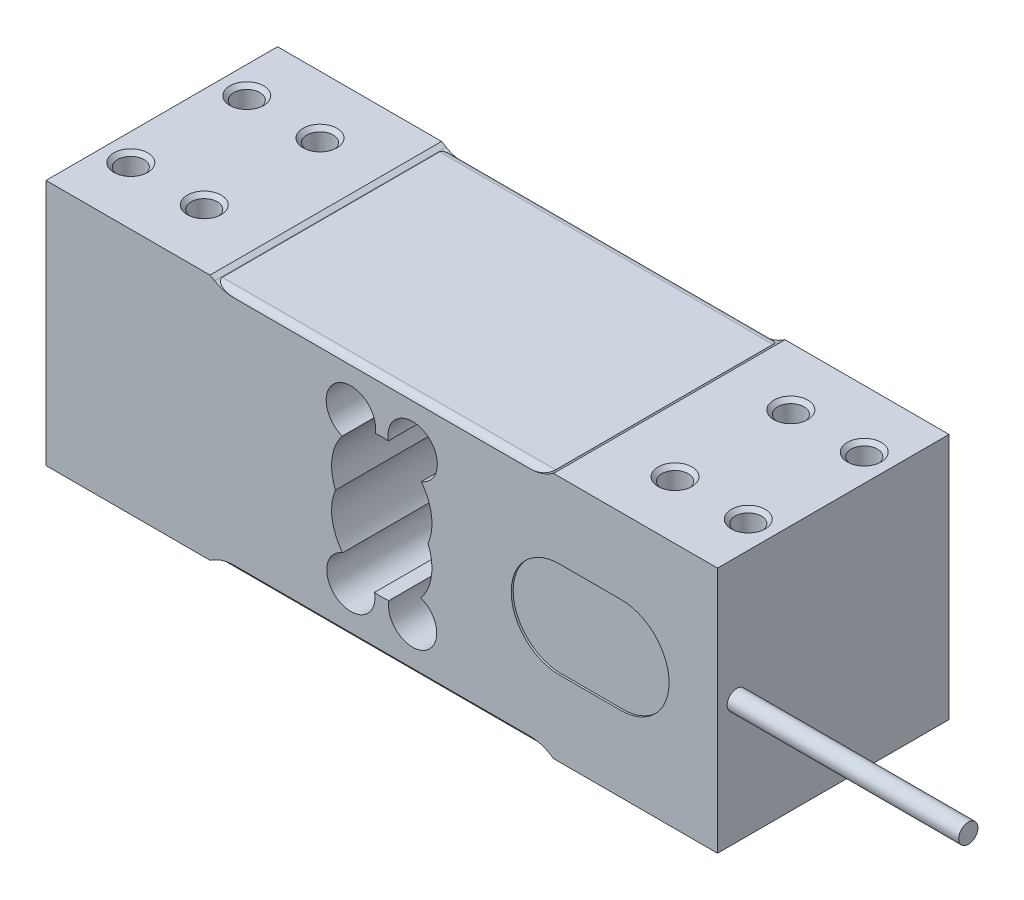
ISO-10303-21;
HEADER;
FILE_DESCRIPTION(('STEP AP214'),'2;1');
FILE_NAME('part.step','',(''),(''),'','','');
FILE_SCHEMA(('AUTOMOTIVE_DESIGN { 1 0 10303 214 1 1 1 1 }'));
ENDSEC;
DATA;
#1=APPLICATION_CONTEXT('core data for automotive mechanical design processes');
#2=APPLICATION_PROTOCOL_DEFINITION('international standard','automotive_design',2000,#1);
#3=PRODUCT_CONTEXT('',#1,'mechanical');
#4=PRODUCT('Part','Part','',(#3));
#5=PRODUCT_RELATED_PRODUCT_CATEGORY('part','',(#4));
#6=PRODUCT_DEFINITION_FORMATION('','',#4);
#7=PRODUCT_DEFINITION_CONTEXT('part definition',#1,'design');
#8=PRODUCT_DEFINITION('design','',#6,#7);
#9=PRODUCT_DEFINITION_SHAPE('','',#8);
#10=(LENGTH_UNIT() NAMED_UNIT(*) SI_UNIT(.MILLI.,.METRE.));
#11=(NAMED_UNIT(*) PLANE_ANGLE_UNIT() SI_UNIT($,.RADIAN.));
#12=(NAMED_UNIT(*) SI_UNIT($,.STERADIAN.) SOLID_ANGLE_UNIT());
#13=UNCERTAINTY_MEASURE_WITH_UNIT(LENGTH_MEASURE(1.E-05),#10,'distance_accuracy_value','');
#14=(GEOMETRIC_REPRESENTATION_CONTEXT(3) GLOBAL_UNCERTAINTY_ASSIGNED_CONTEXT((#13)) GLOBAL_UNIT_ASSIGNED_CONTEXT((#10,
#11,#12)) REPRESENTATION_CONTEXT('',''));
#15=CARTESIAN_POINT('',(0.,0.,0.));
#16=DIRECTION('',(0.,0.,1.));
#17=DIRECTION('',(1.,0.,0.));
#18=AXIS2_PLACEMENT_3D('',#15,#16,#17);
#19=CARTESIAN_POINT('',(38.4089296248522,-40.,-30.));
#20=DIRECTION('',(0.,0.,1.));
#21=DIRECTION('',(1.,0.,0.));
#22=AXIS2_PLACEMENT_3D('',#19,#20,#21);
#23=CYLINDRICAL_SURFACE('',#22,10.);
#24=DIRECTION('',(0.,0.,1.));
#25=VECTOR('',#24,1.);
#26=CARTESIAN_POINT('',(43.2501588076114,-31.25,-30.));
#27=LINE('',#26,#25);
#28=CARTESIAN_POINT('',(43.2501588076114,-31.25,-28.1459503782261));
#29=VERTEX_POINT('',#28);
#30=CARTESIAN_POINT('',(43.2501588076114,-31.25,28.1459503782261));
#31=VERTEX_POINT('',#30);
#32=EDGE_CURVE('E100',#29,#31,#27,.T.);
#33=ORIENTED_EDGE('',*,*,#32,.F.);
#34=CARTESIAN_POINT('',(43.2501588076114,-31.25,-28.1459503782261));
#35=CARTESIAN_POINT('',(43.2501630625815,-31.2500032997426,-28.1747861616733));
#36=CARTESIAN_POINT('',(43.2490307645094,-31.2493757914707,-28.20360621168));
#37=CARTESIAN_POINT('',(43.2445420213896,-31.2468941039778,-28.2609992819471));
#38=CARTESIAN_POINT('',(43.2411871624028,-31.2450407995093,-28.2895724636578));
#39=CARTESIAN_POINT('',(43.2279371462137,-31.2377359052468,-28.3741655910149));
#40=CARTESIAN_POINT('',(43.2148546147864,-31.2305380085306,-28.4295687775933));
#41=CARTESIAN_POINT('',(43.1811284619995,-31.2121403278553,-28.5370819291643));
#42=CARTESIAN_POINT('',(43.1605040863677,-31.2009507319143,-28.5891998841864));
#43=CARTESIAN_POINT('',(43.1128390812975,-31.1753770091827,-28.6896574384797));
#44=CARTESIAN_POINT('',(43.0857848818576,-31.1609861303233,-28.737988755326));
#45=CARTESIAN_POINT('',(43.0086077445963,-31.1204836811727,-28.8582702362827));
#46=CARTESIAN_POINT('',(42.9543902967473,-31.0925246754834,-28.9269660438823));
#47=CARTESIAN_POINT('',(42.8365012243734,-31.0333406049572,-29.0540472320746));
#48=CARTESIAN_POINT('',(42.7728062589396,-31.0021075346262,-29.1124063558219));
#49=CARTESIAN_POINT('',(42.6499751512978,-30.9436557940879,-29.2109538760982));
#50=CARTESIAN_POINT('',(42.5918503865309,-30.9166363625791,-29.252549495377));
#51=CARTESIAN_POINT('',(42.4720374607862,-30.86241381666,-29.3301655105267));
#52=CARTESIAN_POINT('',(42.4103468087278,-30.8352105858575,-29.3661819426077));
#53=CARTESIAN_POINT('',(42.2841411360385,-30.7811357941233,-29.4333841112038));
#54=CARTESIAN_POINT('',(42.219622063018,-30.7542647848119,-29.4645626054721));
#55=CARTESIAN_POINT('',(42.0883952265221,-30.7012607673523,-29.5226801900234));
#56=CARTESIAN_POINT('',(42.0216866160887,-30.675128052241,-29.5496176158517));
#57=CARTESIAN_POINT('',(41.8226993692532,-30.5996875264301,-29.6235283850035));
#58=CARTESIAN_POINT('',(41.6879813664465,-30.5517955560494,-29.6654044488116));
#59=CARTESIAN_POINT('',(41.4140126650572,-30.4611127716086,-29.7386164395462));
#60=CARTESIAN_POINT('',(41.2747577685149,-30.418326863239,-29.7699422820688));
#61=CARTESIAN_POINT('',(40.9926209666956,-30.3384213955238,-29.8245464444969));
#62=CARTESIAN_POINT('',(40.8497290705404,-30.3013199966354,-29.8477992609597));
#63=CARTESIAN_POINT('',(40.5615953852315,-30.2333241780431,-29.8879689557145));
#64=CARTESIAN_POINT('',(40.4163531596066,-30.2024309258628,-29.904884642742));
#65=CARTESIAN_POINT('',(40.1166497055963,-30.1456539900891,-29.9344919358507));
#66=CARTESIAN_POINT('',(39.9620986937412,-30.120109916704,-29.9469213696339));
#67=CARTESIAN_POINT('',(39.6516700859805,-30.0762820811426,-29.9674445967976));
#68=CARTESIAN_POINT('',(39.4957922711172,-30.0579995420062,-29.9755376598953));
#69=CARTESIAN_POINT('',(39.184904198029,-30.0289434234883,-29.9880945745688));
#70=CARTESIAN_POINT('',(39.0299029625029,-30.0180902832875,-29.9925969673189));
#71=CARTESIAN_POINT('',(38.797150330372,-30.0072367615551,-29.9970595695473));
#72=CARTESIAN_POINT('',(38.7195366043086,-30.00452328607,-29.9981652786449));
#73=CARTESIAN_POINT('',(38.5642595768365,-30.0009048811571,-29.9996342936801));
#74=CARTESIAN_POINT('',(38.4865962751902,-29.9999999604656,-29.9999975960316));
#75=CARTESIAN_POINT('',(38.4089296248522,-30.,-30.0000000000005));
#76=B_SPLINE_CURVE_WITH_KNOTS('',3,(#34,#35,#36,#37,#38,#39,#40,#41,#42,#43,#44,#45,#46,#47,#48,
#49,#50,#51,#52,#53,#54,#55,#56,#57,#58,#59,#60,#61,#62,#63,#64,#65,#66,#67,#68,#69,#70,#71,#72,
#73,#74,#75),.UNSPECIFIED.,.F.,.F.,(4,2,2,2,2,2,2,2,2,2,2,2,2,2,2,2,2,2,2,2,4),(0.,
0.0864485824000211,0.17283553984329,0.344101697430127,0.514933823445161,0.686129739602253,
0.960174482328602,1.23490565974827,1.46381739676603,1.69289102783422,1.9223043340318,
2.15180745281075,2.59800823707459,3.0446343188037,3.49265876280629,3.9407673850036,
4.41193613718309,4.88318421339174,5.34930328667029,5.58228922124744,5.8152762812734),.UNSPECIFIED.);
#77=CARTESIAN_POINT('',(38.4089296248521,-30.,-30.));
#78=VERTEX_POINT('',#77);
#79=EDGE_CURVE('E81',#29,#78,#76,.T.);
#80=ORIENTED_EDGE('',*,*,#79,.T.);
#81=DIRECTION('',(0.,0.,1.));
#82=VECTOR('',#81,1.);
#83=CARTESIAN_POINT('',(38.4089296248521,-30.,-30.));
#84=LINE('',#83,#82);
#85=CARTESIAN_POINT('',(38.4089296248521,-30.,30.));
#86=VERTEX_POINT('',#85);
#87=EDGE_CURVE('E98',#78,#86,#84,.T.);
#88=ORIENTED_EDGE('',*,*,#87,.T.);
#89=CARTESIAN_POINT('',(38.4089296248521,-30.,30.));
#90=CARTESIAN_POINT('',(38.5324022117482,-29.9999980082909,29.9999792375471));
#91=CARTESIAN_POINT('',(38.6558767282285,-30.0022867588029,29.9990741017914));
#92=CARTESIAN_POINT('',(38.9026431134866,-30.0114323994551,29.99534665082));
#93=CARTESIAN_POINT('',(39.025934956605,-30.018289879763,29.9925240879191));
#94=CARTESIAN_POINT('',(39.2726614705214,-30.0365999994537,29.9847962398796));
#95=CARTESIAN_POINT('',(39.3960943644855,-30.0480728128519,29.9798818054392));
#96=CARTESIAN_POINT('',(39.642327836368,-30.0755819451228,29.9676646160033));
#97=CARTESIAN_POINT('',(39.7651284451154,-30.0916180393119,29.9603619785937));
#98=CARTESIAN_POINT('',(40.0107260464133,-30.1283348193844,29.9428767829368));
#99=CARTESIAN_POINT('',(40.1335168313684,-30.1490476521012,29.9326741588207));
#100=CARTESIAN_POINT('',(40.3779143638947,-30.194972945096,29.9088164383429));
#101=CARTESIAN_POINT('',(40.4995211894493,-30.2201851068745,29.8951615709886));
#102=CARTESIAN_POINT('',(40.7409511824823,-30.2749310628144,29.8636558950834));
#103=CARTESIAN_POINT('',(40.8607774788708,-30.3044559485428,29.8458136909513));
#104=CARTESIAN_POINT('',(41.0984073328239,-30.3676685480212,29.80493734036));
#105=CARTESIAN_POINT('',(41.2162116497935,-30.4013546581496,29.7819051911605));
#106=CARTESIAN_POINT('',(41.3951867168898,-30.456072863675,29.7415529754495));
#107=CARTESIAN_POINT('',(41.4573010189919,-30.4757339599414,29.7265327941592));
#108=CARTESIAN_POINT('',(41.5806455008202,-30.5160963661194,29.694390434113));
#109=CARTESIAN_POINT('',(41.6418756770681,-30.5367976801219,29.6772682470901));
#110=CARTESIAN_POINT('',(41.7633000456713,-30.5791545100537,29.6406520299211));
#111=CARTESIAN_POINT('',(41.8234941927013,-30.6008100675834,29.6211578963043));
#112=CARTESIAN_POINT('',(41.9426258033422,-30.6449458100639,29.5794925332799));
#113=CARTESIAN_POINT('',(42.0015632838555,-30.6674259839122,29.5573213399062));
#114=CARTESIAN_POINT('',(42.1770767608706,-30.7362613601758,29.485897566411));
#115=CARTESIAN_POINT('',(42.2914622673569,-30.7836989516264,29.431991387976));
#116=CARTESIAN_POINT('',(42.4560542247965,-30.8553626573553,29.3393964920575));
#117=CARTESIAN_POINT('',(42.5097200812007,-30.879318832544,29.306601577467));
#118=CARTESIAN_POINT('',(42.6141648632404,-30.9270026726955,29.2365739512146));
#119=CARTESIAN_POINT('',(42.6649453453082,-30.9507304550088,29.1993436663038));
#120=CARTESIAN_POINT('',(42.7710824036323,-31.0013540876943,29.1132432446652));
#121=CARTESIAN_POINT('',(42.8257814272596,-31.0281151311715,29.0634679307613));
#122=CARTESIAN_POINT('',(42.9285549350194,-31.0794457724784,28.9562940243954));
#123=CARTESIAN_POINT('',(42.9766243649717,-31.1040136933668,28.8988896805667));
#124=CARTESIAN_POINT('',(43.0643511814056,-31.1496028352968,28.7751701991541));
#125=CARTESIAN_POINT('',(43.1038752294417,-31.170566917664,28.7087369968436));
#126=CARTESIAN_POINT('',(43.1702748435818,-31.2061937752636,28.5684185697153));
#127=CARTESIAN_POINT('',(43.1972093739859,-31.2208858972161,28.4945700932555));
#128=CARTESIAN_POINT('',(43.2274050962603,-31.23743996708,28.3741379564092));
#129=CARTESIAN_POINT('',(43.2358599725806,-31.2420998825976,28.3292051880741));
#130=CARTESIAN_POINT('',(43.2472702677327,-31.2484016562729,28.2381911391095));
#131=CARTESIAN_POINT('',(43.2501949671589,-31.2500266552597,28.1921048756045));
#132=CARTESIAN_POINT('',(43.2501588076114,-31.25,28.1459503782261));
#133=B_SPLINE_CURVE_WITH_KNOTS('',3,(#89,#90,#91,#92,#93,#94,#95,#96,#97,#98,#99,#100,#101,#102,
#103,#104,#105,#106,#107,#108,#109,#110,#111,#112,#113,#114,#115,#116,#117,#118,#119,#120,#121,
#122,#123,#124,#125,#126,#127,#128,#129,#130,#131,#132),.UNSPECIFIED.,.F.,.F.,(4,2,2,2,2,2,2,2,
2,2,2,2,2,2,2,2,2,2,2,2,2,4),(0.,0.370396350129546,0.740840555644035,1.11292191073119,
1.48498494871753,1.85968783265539,2.23436586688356,2.60828062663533,2.98205173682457,
3.18259458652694,3.38313822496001,3.58369061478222,3.78424030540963,4.18826612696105,
4.39000789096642,4.59163977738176,4.82703427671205,5.06260725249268,5.30162621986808,
5.5395142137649,5.67697676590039,5.81520068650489),.UNSPECIFIED.);
#134=EDGE_CURVE('E73',#86,#31,#133,.T.);
#135=ORIENTED_EDGE('',*,*,#134,.T.);
#136=EDGE_LOOP('',(#33,#80,#88,#135));
#137=FACE_BOUND('',#136,.T.);
#138=ADVANCED_FACE('F52',(#137),#23,.T.);
#139=CARTESIAN_POINT('',(-43.1855955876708,-31.25,-30.));
#140=DIRECTION('',(0.,-1.,0.));
#141=DIRECTION('',(0.,0.,-1.));
#142=AXIS2_PLACEMENT_3D('',#139,#140,#141);
#143=PLANE('',#142);
#144=DIRECTION('',(0.,0.,1.));
#145=VECTOR('',#144,1.);
#146=CARTESIAN_POINT('',(-43.1855955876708,-31.25,-30.));
#147=LINE('',#146,#145);
#148=CARTESIAN_POINT('',(-43.1855955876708,-31.25,-28.1459503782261));
#149=VERTEX_POINT('',#148);
#150=CARTESIAN_POINT('',(-43.1855955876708,-31.25,28.1459503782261));
#151=VERTEX_POINT('',#150);
#152=EDGE_CURVE('E118',#149,#151,#147,.T.);
#153=ORIENTED_EDGE('',*,*,#152,.F.);
#154=DIRECTION('',(1.,0.,0.));
#155=VECTOR('',#154,1.);
#156=CARTESIAN_POINT('',(43.2501588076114,-31.25,-28.1459503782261));
#157=LINE('',#156,#155);
#158=EDGE_CURVE('E123',#149,#29,#157,.T.);
#159=ORIENTED_EDGE('',*,*,#158,.T.);
#160=ORIENTED_EDGE('',*,*,#32,.T.);
#161=DIRECTION('',(1.,0.,0.));
#162=VECTOR('',#161,1.);
#163=CARTESIAN_POINT('',(-43.1855955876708,-31.25,28.1459503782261));
#164=LINE('',#163,#162);
#165=EDGE_CURVE('E117',#31,#151,#164,.F.);
#166=ORIENTED_EDGE('',*,*,#165,.T.);
#167=EDGE_LOOP('',(#153,#159,#160,#166));
#168=FACE_BOUND('',#167,.T.);
#169=ADVANCED_FACE('F137',(#168),#143,.T.);
#170=CARTESIAN_POINT('',(-38.3443664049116,-40.,-30.));
#171=DIRECTION('',(0.,0.,1.));
#172=DIRECTION('',(1.,0.,0.));
#173=AXIS2_PLACEMENT_3D('',#170,#171,#172);
#174=CYLINDRICAL_SURFACE('',#173,10.);
#175=DIRECTION('',(0.,0.,1.));
#176=VECTOR('',#175,1.);
#177=CARTESIAN_POINT('',(-38.3443664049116,-30.,-30.));
#178=LINE('',#177,#176);
#179=CARTESIAN_POINT('',(-38.3443664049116,-30.,-30.));
#180=VERTEX_POINT('',#179);
#181=CARTESIAN_POINT('',(-38.3443664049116,-30.,30.));
#182=VERTEX_POINT('',#181);
#183=EDGE_CURVE('E110',#180,#182,#178,.T.);
#184=ORIENTED_EDGE('',*,*,#183,.F.);
#185=CARTESIAN_POINT('',(-38.3443664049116,-30.,-30.));
#186=CARTESIAN_POINT('',(-38.4678389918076,-29.9999980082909,-29.9999792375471));
#187=CARTESIAN_POINT('',(-38.591313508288,-30.0022867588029,-29.9990741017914));
#188=CARTESIAN_POINT('',(-38.838079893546,-30.0114323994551,-29.99534665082));
#189=CARTESIAN_POINT('',(-38.9613717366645,-30.018289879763,-29.9925240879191));
#190=CARTESIAN_POINT('',(-39.2080982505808,-30.0365999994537,-29.9847962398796));
#191=CARTESIAN_POINT('',(-39.3315311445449,-30.0480728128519,-29.9798818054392));
#192=CARTESIAN_POINT('',(-39.5777646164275,-30.0755819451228,-29.9676646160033));
#193=CARTESIAN_POINT('',(-39.7005652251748,-30.0916180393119,-29.9603619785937));
#194=CARTESIAN_POINT('',(-39.9461628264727,-30.1283348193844,-29.9428767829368));
#195=CARTESIAN_POINT('',(-40.0689536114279,-30.1490476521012,-29.9326741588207));
#196=CARTESIAN_POINT('',(-40.3133511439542,-30.194972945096,-29.9088164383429));
#197=CARTESIAN_POINT('',(-40.4349579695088,-30.2201851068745,-29.8951615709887));
#198=CARTESIAN_POINT('',(-40.6763879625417,-30.2749310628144,-29.8636558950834));
#199=CARTESIAN_POINT('',(-40.7962142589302,-30.3044559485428,-29.8458136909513));
#200=CARTESIAN_POINT('',(-41.0338441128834,-30.3676685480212,-29.80493734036));
#201=CARTESIAN_POINT('',(-41.1516484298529,-30.4013546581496,-29.7819051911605));
#202=CARTESIAN_POINT('',(-41.3306234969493,-30.456072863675,-29.7415529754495));
#203=CARTESIAN_POINT('',(-41.3927377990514,-30.4757339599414,-29.7265327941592));
#204=CARTESIAN_POINT('',(-41.5160822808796,-30.5160963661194,-29.694390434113));
#205=CARTESIAN_POINT('',(-41.5773124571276,-30.5367976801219,-29.6772682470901));
#206=CARTESIAN_POINT('',(-41.6987368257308,-30.5791545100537,-29.6406520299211));
#207=CARTESIAN_POINT('',(-41.7589309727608,-30.6008100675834,-29.6211578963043));
#208=CARTESIAN_POINT('',(-41.8780625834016,-30.6449458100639,-29.5794925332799));
#209=CARTESIAN_POINT('',(-41.937000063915,-30.6674259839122,-29.5573213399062));
#210=CARTESIAN_POINT('',(-42.11251354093,-30.7362613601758,-29.485897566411));
#211=CARTESIAN_POINT('',(-42.2268990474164,-30.7836989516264,-29.431991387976));
#212=CARTESIAN_POINT('',(-42.391491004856,-30.8553626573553,-29.3393964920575));
#213=CARTESIAN_POINT('',(-42.4451568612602,-30.879318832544,-29.306601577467));
#214=CARTESIAN_POINT('',(-42.5496016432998,-30.9270026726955,-29.2365739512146));
#215=CARTESIAN_POINT('',(-42.6003821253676,-30.9507304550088,-29.1993436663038));
#216=CARTESIAN_POINT('',(-42.7065191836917,-31.0013540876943,-29.1132432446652));
#217=CARTESIAN_POINT('',(-42.7612182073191,-31.0281151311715,-29.0634679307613));
#218=CARTESIAN_POINT('',(-42.8639917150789,-31.0794457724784,-28.9562940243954));
#219=CARTESIAN_POINT('',(-42.9120611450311,-31.1040136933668,-28.8988896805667));
#220=CARTESIAN_POINT('',(-42.999787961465,-31.1496028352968,-28.7751701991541));
#221=CARTESIAN_POINT('',(-43.0393120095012,-31.170566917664,-28.7087369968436));
#222=CARTESIAN_POINT('',(-43.1057116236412,-31.2061937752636,-28.5684185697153));
#223=CARTESIAN_POINT('',(-43.1326461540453,-31.2208858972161,-28.4945700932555));
#224=CARTESIAN_POINT('',(-43.1628418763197,-31.23743996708,-28.3741379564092));
#225=CARTESIAN_POINT('',(-43.17129675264,-31.2420998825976,-28.3292051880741));
#226=CARTESIAN_POINT('',(-43.1827070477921,-31.2484016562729,-28.2381911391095));
#227=CARTESIAN_POINT('',(-43.1856317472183,-31.2500266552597,-28.1921048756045));
#228=CARTESIAN_POINT('',(-43.1855955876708,-31.25,-28.1459503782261));
#229=B_SPLINE_CURVE_WITH_KNOTS('',3,(#185,#186,#187,#188,#189,#190,#191,#192,#193,#194,#195,
#196,#197,#198,#199,#200,#201,#202,#203,#204,#205,#206,#207,#208,#209,#210,#211,#212,#213,#214,
#215,#216,#217,#218,#219,#220,#221,#222,#223,#224,#225,#226,#227,#228),.UNSPECIFIED.,.F.,.F.,(4,
2,2,2,2,2,2,2,2,2,2,2,2,2,2,2,2,2,2,2,2,4),(0.,0.370396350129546,0.740840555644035,
1.11292191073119,1.48498494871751,1.85968783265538,2.23436586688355,2.60828062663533,
2.98205173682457,3.18259458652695,3.38313822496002,3.58369061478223,3.78424030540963,
4.18826612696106,4.39000789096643,4.59163977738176,4.82703427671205,5.06260725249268,
5.30162621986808,5.5395142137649,5.67697676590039,5.81520068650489),.UNSPECIFIED.);
#230=EDGE_CURVE('E12',#180,#149,#229,.T.);
#231=ORIENTED_EDGE('',*,*,#230,.T.);
#232=ORIENTED_EDGE('',*,*,#152,.T.);
#233=CARTESIAN_POINT('',(-43.1855955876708,-31.25,28.1459503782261));
#234=CARTESIAN_POINT('',(-43.185599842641,-31.2500032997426,28.1747861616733));
#235=CARTESIAN_POINT('',(-43.1844675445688,-31.2493757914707,28.20360621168));
#236=CARTESIAN_POINT('',(-43.1799788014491,-31.2468941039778,28.2609992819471));
#237=CARTESIAN_POINT('',(-43.1766239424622,-31.2450407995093,28.2895724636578));
#238=CARTESIAN_POINT('',(-43.1633739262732,-31.2377359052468,28.3741655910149));
#239=CARTESIAN_POINT('',(-43.1502913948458,-31.2305380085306,28.4295687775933));
#240=CARTESIAN_POINT('',(-43.116565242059,-31.2121403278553,28.5370819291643));
#241=CARTESIAN_POINT('',(-43.0959408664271,-31.2009507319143,28.5891998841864));
#242=CARTESIAN_POINT('',(-43.0482758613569,-31.1753770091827,28.6896574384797));
#243=CARTESIAN_POINT('',(-43.021221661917,-31.1609861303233,28.737988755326));
#244=CARTESIAN_POINT('',(-42.9440445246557,-31.1204836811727,28.8582702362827));
#245=CARTESIAN_POINT('',(-42.8898270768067,-31.0925246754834,28.9269660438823));
#246=CARTESIAN_POINT('',(-42.7719380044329,-31.0333406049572,29.0540472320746));
#247=CARTESIAN_POINT('',(-42.7082430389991,-31.0021075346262,29.1124063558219));
#248=CARTESIAN_POINT('',(-42.5854119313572,-30.9436557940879,29.2109538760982));
#249=CARTESIAN_POINT('',(-42.5272871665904,-30.9166363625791,29.252549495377));
#250=CARTESIAN_POINT('',(-42.4074742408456,-30.86241381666,29.3301655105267));
#251=CARTESIAN_POINT('',(-42.3457835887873,-30.8352105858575,29.3661819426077));
#252=CARTESIAN_POINT('',(-42.2195779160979,-30.7811357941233,29.4333841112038));
#253=CARTESIAN_POINT('',(-42.1550588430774,-30.7542647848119,29.4645626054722));
#254=CARTESIAN_POINT('',(-42.0238320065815,-30.7012607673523,29.5226801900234));
#255=CARTESIAN_POINT('',(-41.9571233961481,-30.675128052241,29.5496176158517));
#256=CARTESIAN_POINT('',(-41.7581361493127,-30.5996875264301,29.6235283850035));
#257=CARTESIAN_POINT('',(-41.6234181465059,-30.5517955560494,29.6654044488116));
#258=CARTESIAN_POINT('',(-41.3494494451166,-30.4611127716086,29.7386164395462));
#259=CARTESIAN_POINT('',(-41.2101945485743,-30.418326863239,29.7699422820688));
#260=CARTESIAN_POINT('',(-40.9280577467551,-30.3384213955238,29.8245464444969));
#261=CARTESIAN_POINT('',(-40.7851658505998,-30.3013199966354,29.8477992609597));
#262=CARTESIAN_POINT('',(-40.4970321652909,-30.2333241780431,29.8879689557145));
#263=CARTESIAN_POINT('',(-40.3517899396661,-30.2024309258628,29.904884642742));
#264=CARTESIAN_POINT('',(-40.0520864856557,-30.1456539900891,29.9344919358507));
#265=CARTESIAN_POINT('',(-39.8975354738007,-30.120109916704,29.9469213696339));
#266=CARTESIAN_POINT('',(-39.58710686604,-30.0762820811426,29.9674445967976));
#267=CARTESIAN_POINT('',(-39.4312290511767,-30.0579995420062,29.9755376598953));
#268=CARTESIAN_POINT('',(-39.1203409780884,-30.0289434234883,29.9880945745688));
#269=CARTESIAN_POINT('',(-38.9653397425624,-30.0180902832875,29.9925969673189));
#270=CARTESIAN_POINT('',(-38.7325871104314,-30.0072367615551,29.9970595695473));
#271=CARTESIAN_POINT('',(-38.6549733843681,-30.00452328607,29.9981652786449));
#272=CARTESIAN_POINT('',(-38.499696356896,-30.0009048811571,29.9996342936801));
#273=CARTESIAN_POINT('',(-38.4220330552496,-29.9999999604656,29.9999975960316));
#274=CARTESIAN_POINT('',(-38.3443664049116,-30.,30.0000000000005));
#275=B_SPLINE_CURVE_WITH_KNOTS('',3,(#233,#234,#235,#236,#237,#238,#239,#240,#241,#242,#243,
#244,#245,#246,#247,#248,#249,#250,#251,#252,#253,#254,#255,#256,#257,#258,#259,#260,#261,#262,
#263,#264,#265,#266,#267,#268,#269,#270,#271,#272,#273,#274),.UNSPECIFIED.,.F.,.F.,(4,2,2,2,2,2,
2,2,2,2,2,2,2,2,2,2,2,2,2,2,4),(0.,0.0864485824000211,0.17283553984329,0.344101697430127,
0.514933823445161,0.686129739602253,0.960174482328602,1.23490565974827,1.46381739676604,
1.69289102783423,1.92230433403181,2.15180745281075,2.59800823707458,3.04463431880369,
3.49265876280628,3.9407673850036,4.41193613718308,4.88318421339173,5.34930328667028,
5.58228922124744,5.8152762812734),.UNSPECIFIED.);
#276=EDGE_CURVE('E66',#151,#182,#275,.T.);
#277=ORIENTED_EDGE('',*,*,#276,.T.);
#278=EDGE_LOOP('',(#184,#231,#232,#277));
#279=FACE_BOUND('',#278,.T.);
#280=ADVANCED_FACE('F147',(#279),#174,.T.);
#281=CARTESIAN_POINT('',(-38.3443664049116,-30.,-30.));
#282=DIRECTION('',(0.,1.,0.));
#283=DIRECTION('',(0.,0.,1.));
#284=AXIS2_PLACEMENT_3D('',#281,#282,#283);
#285=PLANE('',#284);
#286=DIRECTION('',(-1.,0.,0.));
#287=VECTOR('',#286,1.);
#288=CARTESIAN_POINT('',(-38.3443664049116,-30.,30.));
#289=LINE('',#288,#287);
#290=EDGE_CURVE('E109',#86,#182,#289,.T.);
#291=ORIENTED_EDGE('',*,*,#290,.F.);
#292=ORIENTED_EDGE('',*,*,#87,.F.);
#293=DIRECTION('',(-1.,0.,0.));
#294=VECTOR('',#293,1.);
#295=CARTESIAN_POINT('',(-38.3443664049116,-30.,-30.));
#296=LINE('',#295,#294);
#297=EDGE_CURVE('E106',#78,#180,#296,.T.);
#298=ORIENTED_EDGE('',*,*,#297,.T.);
#299=ORIENTED_EDGE('',*,*,#183,.T.);
#300=EDGE_LOOP('',(#291,#292,#298,#299));
#301=FACE_BOUND('',#300,.T.);
#302=ADVANCED_FACE('F104',(#301),#285,.T.);
#303=CARTESIAN_POINT('',(38.4089296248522,-29.25,-28.1459503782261));
#304=DIRECTION('',(-1.,0.,0.));
#305=DIRECTION('',(0.,0.,1.));
#306=AXIS2_PLACEMENT_3D('',#303,#304,#305);
#307=CYLINDRICAL_SURFACE('',#306,2.);
#308=ORIENTED_EDGE('',*,*,#230,.F.);
#309=ORIENTED_EDGE('',*,*,#297,.F.);
#310=ORIENTED_EDGE('',*,*,#79,.F.);
#311=ORIENTED_EDGE('',*,*,#158,.F.);
#312=EDGE_LOOP('',(#308,#309,#310,#311));
#313=FACE_BOUND('',#312,.T.);
#314=ADVANCED_FACE('F112',(#313),#307,.T.);
#315=CARTESIAN_POINT('',(38.4089296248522,-29.25,28.1459503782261));
#316=DIRECTION('',(-1.,0.,0.));
#317=DIRECTION('',(0.,0.,1.));
#318=AXIS2_PLACEMENT_3D('',#315,#316,#317);
#319=CYLINDRICAL_SURFACE('',#318,2.);
#320=ORIENTED_EDGE('',*,*,#276,.F.);
#321=ORIENTED_EDGE('',*,*,#165,.F.);
#322=ORIENTED_EDGE('',*,*,#134,.F.);
#323=ORIENTED_EDGE('',*,*,#290,.T.);
#324=EDGE_LOOP('',(#320,#321,#322,#323));
#325=FACE_BOUND('',#324,.T.);
#326=ADVANCED_FACE('F54',(#325),#319,.T.);
#327=CLOSED_SHELL('',(#138,#169,#280,#302,#314,#326));
#328=MANIFOLD_SOLID_BREP('B2',#327);
#329=CARTESIAN_POINT('',(-38.3443664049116,40.,-30.));
#330=DIRECTION('',(0.,0.,1.));
#331=DIRECTION('',(1.,0.,0.));
#332=AXIS2_PLACEMENT_3D('',#329,#330,#331);
#333=CYLINDRICAL_SURFACE('',#332,10.);
#334=DIRECTION('',(0.,0.,1.));
#335=VECTOR('',#334,1.);
#336=CARTESIAN_POINT('',(-43.1855955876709,31.25,-30.));
#337=LINE('',#336,#335);
#338=CARTESIAN_POINT('',(-43.1855955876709,31.25,-28.1459503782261));
#339=VERTEX_POINT('',#338);
#340=CARTESIAN_POINT('',(-43.1855955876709,31.25,28.1459503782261));
#341=VERTEX_POINT('',#340);
#342=EDGE_CURVE('E257',#339,#341,#337,.T.);
#343=ORIENTED_EDGE('',*,*,#342,.F.);
#344=CARTESIAN_POINT('',(-43.1855955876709,31.25,-28.1459503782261));
#345=CARTESIAN_POINT('',(-43.185599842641,31.2500032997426,-28.1747861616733));
#346=CARTESIAN_POINT('',(-43.1844675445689,31.2493757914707,-28.20360621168));
#347=CARTESIAN_POINT('',(-43.1799788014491,31.2468941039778,-28.2609992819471));
#348=CARTESIAN_POINT('',(-43.1766239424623,31.2450407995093,-28.2895724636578));
#349=CARTESIAN_POINT('',(-43.1633739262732,31.2377359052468,-28.3741655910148));
#350=CARTESIAN_POINT('',(-43.1502913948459,31.2305380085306,-28.4295687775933));
#351=CARTESIAN_POINT('',(-43.116565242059,31.2121403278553,-28.5370819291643));
#352=CARTESIAN_POINT('',(-43.0959408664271,31.2009507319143,-28.5891998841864));
#353=CARTESIAN_POINT('',(-43.048275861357,31.1753770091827,-28.6896574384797));
#354=CARTESIAN_POINT('',(-43.0212216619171,31.1609861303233,-28.737988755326));
#355=CARTESIAN_POINT('',(-42.9440445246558,31.1204836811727,-28.8582702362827));
#356=CARTESIAN_POINT('',(-42.8898270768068,31.0925246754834,-28.9269660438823));
#357=CARTESIAN_POINT('',(-42.7719380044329,31.0333406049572,-29.0540472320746));
#358=CARTESIAN_POINT('',(-42.7082430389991,31.0021075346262,-29.1124063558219));
#359=CARTESIAN_POINT('',(-42.5854119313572,30.9436557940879,-29.2109538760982));
#360=CARTESIAN_POINT('',(-42.5272871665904,30.9166363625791,-29.252549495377));
#361=CARTESIAN_POINT('',(-42.4074742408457,30.86241381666,-29.3301655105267));
#362=CARTESIAN_POINT('',(-42.3457835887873,30.8352105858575,-29.3661819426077));
#363=CARTESIAN_POINT('',(-42.219577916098,30.7811357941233,-29.4333841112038));
#364=CARTESIAN_POINT('',(-42.1550588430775,30.7542647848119,-29.4645626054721));
#365=CARTESIAN_POINT('',(-42.0238320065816,30.7012607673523,-29.5226801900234));
#366=CARTESIAN_POINT('',(-41.9571233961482,30.675128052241,-29.5496176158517));
#367=CARTESIAN_POINT('',(-41.7581361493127,30.5996875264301,-29.6235283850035));
#368=CARTESIAN_POINT('',(-41.623418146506,30.5517955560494,-29.6654044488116));
#369=CARTESIAN_POINT('',(-41.3494494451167,30.4611127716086,-29.7386164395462));
#370=CARTESIAN_POINT('',(-41.2101945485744,30.418326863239,-29.7699422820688));
#371=CARTESIAN_POINT('',(-40.9280577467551,30.3384213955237,-29.8245464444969));
#372=CARTESIAN_POINT('',(-40.7851658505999,30.3013199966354,-29.8477992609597));
#373=CARTESIAN_POINT('',(-40.497032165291,30.2333241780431,-29.8879689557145));
#374=CARTESIAN_POINT('',(-40.3517899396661,30.2024309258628,-29.904884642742));
#375=CARTESIAN_POINT('',(-40.0520864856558,30.1456539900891,-29.9344919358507));
#376=CARTESIAN_POINT('',(-39.8975354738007,30.120109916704,-29.9469213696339));
#377=CARTESIAN_POINT('',(-39.58710686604,30.0762820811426,-29.9674445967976));
#378=CARTESIAN_POINT('',(-39.4312290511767,30.0579995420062,-29.9755376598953));
#379=CARTESIAN_POINT('',(-39.1203409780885,30.0289434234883,-29.9880945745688));
#380=CARTESIAN_POINT('',(-38.9653397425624,30.0180902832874,-29.9925969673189));
#381=CARTESIAN_POINT('',(-38.7325871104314,30.0072367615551,-29.9970595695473));
#382=CARTESIAN_POINT('',(-38.6549733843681,30.00452328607,-29.9981652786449));
#383=CARTESIAN_POINT('',(-38.499696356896,30.0009048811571,-29.9996342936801));
#384=CARTESIAN_POINT('',(-38.4220330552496,29.9999999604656,-29.9999975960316));
#385=CARTESIAN_POINT('',(-38.3443664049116,30.,-30.0000000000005));
#386=B_SPLINE_CURVE_WITH_KNOTS('',3,(#344,#345,#346,#347,#348,#349,#350,#351,#352,#353,#354,
#355,#356,#357,#358,#359,#360,#361,#362,#363,#364,#365,#366,#367,#368,#369,#370,#371,#372,#373,
#374,#375,#376,#377,#378,#379,#380,#381,#382,#383,#384,#385),.UNSPECIFIED.,.F.,.F.,(4,2,2,2,2,2,
2,2,2,2,2,2,2,2,2,2,2,2,2,2,4),(0.,0.0864485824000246,0.172835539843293,0.344101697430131,
0.514933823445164,0.686129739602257,0.960174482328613,1.23490565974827,1.46381739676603,
1.69289102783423,1.9223043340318,2.15180745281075,2.59800823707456,3.04463431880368,
3.49265876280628,3.94076738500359,4.41193613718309,4.88318421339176,5.34930328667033,
5.58228922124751,5.81527628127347),.UNSPECIFIED.);
#387=CARTESIAN_POINT('',(-38.3443664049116,30.,-30.));
#388=VERTEX_POINT('',#387);
#389=EDGE_CURVE('E238',#339,#388,#386,.T.);
#390=ORIENTED_EDGE('',*,*,#389,.T.);
#391=DIRECTION('',(0.,0.,1.));
#392=VECTOR('',#391,1.);
#393=CARTESIAN_POINT('',(-38.3443664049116,30.,-30.));
#394=LINE('',#393,#392);
#395=CARTESIAN_POINT('',(-38.3443664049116,30.,30.));
#396=VERTEX_POINT('',#395);
#397=EDGE_CURVE('E255',#388,#396,#394,.T.);
#398=ORIENTED_EDGE('',*,*,#397,.T.);
#399=CARTESIAN_POINT('',(-38.3443664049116,30.,30.));
#400=CARTESIAN_POINT('',(-38.4678389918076,29.9999980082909,29.9999792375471));
#401=CARTESIAN_POINT('',(-38.591313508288,30.0022867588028,29.9990741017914));
#402=CARTESIAN_POINT('',(-38.8380798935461,30.0114323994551,29.99534665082));
#403=CARTESIAN_POINT('',(-38.9613717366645,30.0182898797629,29.9925240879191));
#404=CARTESIAN_POINT('',(-39.2080982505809,30.0365999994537,29.9847962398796));
#405=CARTESIAN_POINT('',(-39.3315311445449,30.0480728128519,29.9798818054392));
#406=CARTESIAN_POINT('',(-39.5777646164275,30.0755819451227,29.9676646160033));
#407=CARTESIAN_POINT('',(-39.7005652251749,30.0916180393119,29.9603619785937));
#408=CARTESIAN_POINT('',(-39.9461628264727,30.1283348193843,29.9428767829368));
#409=CARTESIAN_POINT('',(-40.0689536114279,30.1490476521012,29.9326741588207));
#410=CARTESIAN_POINT('',(-40.3133511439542,30.1949729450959,29.9088164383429));
#411=CARTESIAN_POINT('',(-40.4349579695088,30.2201851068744,29.8951615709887));
#412=CARTESIAN_POINT('',(-40.6763879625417,30.2749310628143,29.8636558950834));
#413=CARTESIAN_POINT('',(-40.7962142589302,30.3044559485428,29.8458136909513));
#414=CARTESIAN_POINT('',(-41.0338441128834,30.3676685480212,29.80493734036));
#415=CARTESIAN_POINT('',(-41.1516484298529,30.4013546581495,29.7819051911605));
#416=CARTESIAN_POINT('',(-41.3306234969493,30.456072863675,29.7415529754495));
#417=CARTESIAN_POINT('',(-41.3927377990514,30.4757339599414,29.7265327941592));
#418=CARTESIAN_POINT('',(-41.5160822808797,30.5160963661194,29.694390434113));
#419=CARTESIAN_POINT('',(-41.5773124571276,30.5367976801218,29.6772682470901));
#420=CARTESIAN_POINT('',(-41.6987368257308,30.5791545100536,29.6406520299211));
#421=CARTESIAN_POINT('',(-41.7589309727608,30.6008100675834,29.6211578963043));
#422=CARTESIAN_POINT('',(-41.8780625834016,30.6449458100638,29.5794925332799));
#423=CARTESIAN_POINT('',(-41.937000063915,30.6674259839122,29.5573213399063));
#424=CARTESIAN_POINT('',(-42.1125135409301,30.7362613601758,29.485897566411));
#425=CARTESIAN_POINT('',(-42.2268990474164,30.7836989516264,29.431991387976));
#426=CARTESIAN_POINT('',(-42.391491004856,30.8553626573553,29.3393964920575));
#427=CARTESIAN_POINT('',(-42.4451568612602,30.879318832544,29.306601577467));
#428=CARTESIAN_POINT('',(-42.5496016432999,30.9270026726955,29.2365739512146));
#429=CARTESIAN_POINT('',(-42.6003821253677,30.9507304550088,29.1993436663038));
#430=CARTESIAN_POINT('',(-42.7065191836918,31.0013540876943,29.1132432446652));
#431=CARTESIAN_POINT('',(-42.7612182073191,31.0281151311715,29.0634679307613));
#432=CARTESIAN_POINT('',(-42.8639917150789,31.0794457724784,28.9562940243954));
#433=CARTESIAN_POINT('',(-42.9120611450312,31.1040136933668,28.8988896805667));
#434=CARTESIAN_POINT('',(-42.9997879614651,31.1496028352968,28.7751701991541));
#435=CARTESIAN_POINT('',(-43.0393120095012,31.170566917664,28.7087369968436));
#436=CARTESIAN_POINT('',(-43.1057116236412,31.2061937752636,28.5684185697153));
#437=CARTESIAN_POINT('',(-43.1326461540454,31.2208858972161,28.4945700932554));
#438=CARTESIAN_POINT('',(-43.1628418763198,31.23743996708,28.3741379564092));
#439=CARTESIAN_POINT('',(-43.1712967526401,31.2420998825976,28.3292051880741));
#440=CARTESIAN_POINT('',(-43.1827070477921,31.2484016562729,28.2381911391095));
#441=CARTESIAN_POINT('',(-43.1856317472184,31.2500266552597,28.1921048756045));
#442=CARTESIAN_POINT('',(-43.1855955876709,31.25,28.1459503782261));
#443=B_SPLINE_CURVE_WITH_KNOTS('',3,(#399,#400,#401,#402,#403,#404,#405,#406,#407,#408,#409,
#410,#411,#412,#413,#414,#415,#416,#417,#418,#419,#420,#421,#422,#423,#424,#425,#426,#427,#428,
#429,#430,#431,#432,#433,#434,#435,#436,#437,#438,#439,#440,#441,#442),.UNSPECIFIED.,.F.,.F.,(4,
2,2,2,2,2,2,2,2,2,2,2,2,2,2,2,2,2,2,2,2,4),(0.,0.370396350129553,0.740840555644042,
1.11292191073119,1.48498494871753,1.85968783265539,2.23436586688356,2.60828062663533,
2.9820517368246,3.18259458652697,3.38313822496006,3.58369061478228,3.78424030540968,
4.18826612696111,4.39000789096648,4.59163977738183,4.82703427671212,5.06260725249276,
5.30162621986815,5.53951421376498,5.67697676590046,5.81520068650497),.UNSPECIFIED.);
#444=EDGE_CURVE('E230',#396,#341,#443,.T.);
#445=ORIENTED_EDGE('',*,*,#444,.T.);
#446=EDGE_LOOP('',(#343,#390,#398,#445));
#447=FACE_BOUND('',#446,.T.);
#448=ADVANCED_FACE('F209',(#447),#333,.T.);
#449=CARTESIAN_POINT('',(-43.1855955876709,31.25,-30.));
#450=DIRECTION('',(0.,1.,0.));
#451=DIRECTION('',(0.,0.,1.));
#452=AXIS2_PLACEMENT_3D('',#449,#450,#451);
#453=PLANE('',#452);
#454=DIRECTION('',(0.,0.,1.));
#455=VECTOR('',#454,1.);
#456=CARTESIAN_POINT('',(43.2501588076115,31.25,-30.));
#457=LINE('',#456,#455);
#458=CARTESIAN_POINT('',(43.2501588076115,31.25,-28.1459503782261));
#459=VERTEX_POINT('',#458);
#460=CARTESIAN_POINT('',(43.2501588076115,31.25,28.1459503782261));
#461=VERTEX_POINT('',#460);
#462=EDGE_CURVE('E275',#459,#461,#457,.T.);
#463=ORIENTED_EDGE('',*,*,#462,.F.);
#464=DIRECTION('',(-1.,0.,0.));
#465=VECTOR('',#464,1.);
#466=CARTESIAN_POINT('',(-43.1855955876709,31.25,-28.1459503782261));
#467=LINE('',#466,#465);
#468=EDGE_CURVE('E280',#459,#339,#467,.T.);
#469=ORIENTED_EDGE('',*,*,#468,.T.);
#470=ORIENTED_EDGE('',*,*,#342,.T.);
#471=DIRECTION('',(-1.,0.,0.));
#472=VECTOR('',#471,1.);
#473=CARTESIAN_POINT('',(43.2501588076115,31.25,28.1459503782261));
#474=LINE('',#473,#472);
#475=EDGE_CURVE('E274',#341,#461,#474,.F.);
#476=ORIENTED_EDGE('',*,*,#475,.T.);
#477=EDGE_LOOP('',(#463,#469,#470,#476));
#478=FACE_BOUND('',#477,.T.);
#479=ADVANCED_FACE('F294',(#478),#453,.T.);
#480=CARTESIAN_POINT('',(38.4089296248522,40.,-30.));
#481=DIRECTION('',(0.,0.,1.));
#482=DIRECTION('',(1.,0.,0.));
#483=AXIS2_PLACEMENT_3D('',#480,#481,#482);
#484=CYLINDRICAL_SURFACE('',#483,10.);
#485=DIRECTION('',(0.,0.,1.));
#486=VECTOR('',#485,1.);
#487=CARTESIAN_POINT('',(38.4089296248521,30.,-30.));
#488=LINE('',#487,#486);
#489=CARTESIAN_POINT('',(38.4089296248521,30.,-30.));
#490=VERTEX_POINT('',#489);
#491=CARTESIAN_POINT('',(38.4089296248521,30.,30.));
#492=VERTEX_POINT('',#491);
#493=EDGE_CURVE('E267',#490,#492,#488,.T.);
#494=ORIENTED_EDGE('',*,*,#493,.F.);
#495=CARTESIAN_POINT('',(38.4089296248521,30.,-30.));
#496=CARTESIAN_POINT('',(38.5324022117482,29.9999980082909,-29.9999792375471));
#497=CARTESIAN_POINT('',(38.6558767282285,30.0022867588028,-29.9990741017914));
#498=CARTESIAN_POINT('',(38.9026431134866,30.0114323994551,-29.99534665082));
#499=CARTESIAN_POINT('',(39.025934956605,30.0182898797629,-29.9925240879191));
#500=CARTESIAN_POINT('',(39.2726614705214,30.0365999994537,-29.9847962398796));
#501=CARTESIAN_POINT('',(39.3960943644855,30.0480728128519,-29.9798818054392));
#502=CARTESIAN_POINT('',(39.642327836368,30.0755819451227,-29.9676646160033));
#503=CARTESIAN_POINT('',(39.7651284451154,30.0916180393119,-29.9603619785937));
#504=CARTESIAN_POINT('',(40.0107260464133,30.1283348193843,-29.9428767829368));
#505=CARTESIAN_POINT('',(40.1335168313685,30.1490476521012,-29.9326741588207));
#506=CARTESIAN_POINT('',(40.3779143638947,30.1949729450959,-29.9088164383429));
#507=CARTESIAN_POINT('',(40.4995211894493,30.2201851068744,-29.8951615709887));
#508=CARTESIAN_POINT('',(40.7409511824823,30.2749310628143,-29.8636558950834));
#509=CARTESIAN_POINT('',(40.8607774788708,30.3044559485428,-29.8458136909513));
#510=CARTESIAN_POINT('',(41.098407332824,30.3676685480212,-29.80493734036));
#511=CARTESIAN_POINT('',(41.2162116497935,30.4013546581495,-29.7819051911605));
#512=CARTESIAN_POINT('',(41.3951867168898,30.456072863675,-29.7415529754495));
#513=CARTESIAN_POINT('',(41.4573010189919,30.4757339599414,-29.7265327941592));
#514=CARTESIAN_POINT('',(41.5806455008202,30.5160963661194,-29.694390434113));
#515=CARTESIAN_POINT('',(41.6418756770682,30.5367976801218,-29.6772682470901));
#516=CARTESIAN_POINT('',(41.7633000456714,30.5791545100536,-29.6406520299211));
#517=CARTESIAN_POINT('',(41.8234941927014,30.6008100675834,-29.6211578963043));
#518=CARTESIAN_POINT('',(41.9426258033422,30.6449458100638,-29.5794925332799));
#519=CARTESIAN_POINT('',(42.0015632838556,30.6674259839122,-29.5573213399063));
#520=CARTESIAN_POINT('',(42.1770767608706,30.7362613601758,-29.485897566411));
#521=CARTESIAN_POINT('',(42.291462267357,30.7836989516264,-29.4319913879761));
#522=CARTESIAN_POINT('',(42.4560542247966,30.8553626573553,-29.3393964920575));
#523=CARTESIAN_POINT('',(42.5097200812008,30.879318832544,-29.306601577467));
#524=CARTESIAN_POINT('',(42.6141648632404,30.9270026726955,-29.2365739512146));
#525=CARTESIAN_POINT('',(42.6649453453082,30.9507304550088,-29.1993436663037));
#526=CARTESIAN_POINT('',(42.7710824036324,31.0013540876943,-29.1132432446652));
#527=CARTESIAN_POINT('',(42.8257814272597,31.0281151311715,-29.0634679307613));
#528=CARTESIAN_POINT('',(42.9285549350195,31.0794457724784,-28.9562940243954));
#529=CARTESIAN_POINT('',(42.9766243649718,31.1040136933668,-28.8988896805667));
#530=CARTESIAN_POINT('',(43.0643511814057,31.1496028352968,-28.7751701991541));
#531=CARTESIAN_POINT('',(43.1038752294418,31.170566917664,-28.7087369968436));
#532=CARTESIAN_POINT('',(43.1702748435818,31.2061937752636,-28.5684185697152));
#533=CARTESIAN_POINT('',(43.1972093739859,31.2208858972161,-28.4945700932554));
#534=CARTESIAN_POINT('',(43.2274050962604,31.23743996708,-28.3741379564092));
#535=CARTESIAN_POINT('',(43.2358599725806,31.2420998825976,-28.3292051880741));
#536=CARTESIAN_POINT('',(43.2472702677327,31.2484016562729,-28.2381911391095));
#537=CARTESIAN_POINT('',(43.2501949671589,31.2500266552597,-28.1921048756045));
#538=CARTESIAN_POINT('',(43.2501588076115,31.25,-28.1459503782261));
#539=B_SPLINE_CURVE_WITH_KNOTS('',3,(#495,#496,#497,#498,#499,#500,#501,#502,#503,#504,#505,
#506,#507,#508,#509,#510,#511,#512,#513,#514,#515,#516,#517,#518,#519,#520,#521,#522,#523,#524,
#525,#526,#527,#528,#529,#530,#531,#532,#533,#534,#535,#536,#537,#538),.UNSPECIFIED.,.F.,.F.,(4,
2,2,2,2,2,2,2,2,2,2,2,2,2,2,2,2,2,2,2,2,4),(0.,0.370396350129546,0.740840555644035,
1.11292191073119,1.48498494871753,1.8596878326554,2.23436586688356,2.60828062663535,
2.9820517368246,3.18259458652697,3.38313822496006,3.58369061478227,3.78424030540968,
4.18826612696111,4.39000789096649,4.59163977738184,4.82703427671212,5.06260725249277,
5.30162621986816,5.53951421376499,5.67697676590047,5.81520068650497),.UNSPECIFIED.);
#540=EDGE_CURVE('E50',#490,#459,#539,.T.);
#541=ORIENTED_EDGE('',*,*,#540,.T.);
#542=ORIENTED_EDGE('',*,*,#462,.T.);
#543=CARTESIAN_POINT('',(43.2501588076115,31.25,28.1459503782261));
#544=CARTESIAN_POINT('',(43.2501630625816,31.2500032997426,28.1747861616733));
#545=CARTESIAN_POINT('',(43.2490307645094,31.2493757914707,28.20360621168));
#546=CARTESIAN_POINT('',(43.2445420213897,31.2468941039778,28.2609992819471));
#547=CARTESIAN_POINT('',(43.2411871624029,31.2450407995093,28.2895724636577));
#548=CARTESIAN_POINT('',(43.2279371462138,31.2377359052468,28.3741655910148));
#549=CARTESIAN_POINT('',(43.2148546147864,31.2305380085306,28.4295687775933));
#550=CARTESIAN_POINT('',(43.1811284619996,31.2121403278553,28.5370819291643));
#551=CARTESIAN_POINT('',(43.1605040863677,31.2009507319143,28.5891998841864));
#552=CARTESIAN_POINT('',(43.1128390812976,31.1753770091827,28.6896574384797));
#553=CARTESIAN_POINT('',(43.0857848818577,31.1609861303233,28.737988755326));
#554=CARTESIAN_POINT('',(43.0086077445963,31.1204836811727,28.8582702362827));
#555=CARTESIAN_POINT('',(42.9543902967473,31.0925246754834,28.9269660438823));
#556=CARTESIAN_POINT('',(42.8365012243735,31.0333406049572,29.0540472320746));
#557=CARTESIAN_POINT('',(42.7728062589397,31.0021075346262,29.1124063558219));
#558=CARTESIAN_POINT('',(42.6499751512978,30.9436557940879,29.2109538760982));
#559=CARTESIAN_POINT('',(42.591850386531,30.9166363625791,29.252549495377));
#560=CARTESIAN_POINT('',(42.4720374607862,30.86241381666,29.3301655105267));
#561=CARTESIAN_POINT('',(42.4103468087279,30.8352105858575,29.3661819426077));
#562=CARTESIAN_POINT('',(42.2841411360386,30.7811357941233,29.4333841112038));
#563=CARTESIAN_POINT('',(42.2196220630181,30.7542647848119,29.4645626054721));
#564=CARTESIAN_POINT('',(42.0883952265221,30.7012607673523,29.5226801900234));
#565=CARTESIAN_POINT('',(42.0216866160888,30.675128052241,29.5496176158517));
#566=CARTESIAN_POINT('',(41.8226993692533,30.5996875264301,29.6235283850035));
#567=CARTESIAN_POINT('',(41.6879813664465,30.5517955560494,29.6654044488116));
#568=CARTESIAN_POINT('',(41.4140126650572,30.4611127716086,29.7386164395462));
#569=CARTESIAN_POINT('',(41.274757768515,30.418326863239,29.7699422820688));
#570=CARTESIAN_POINT('',(40.9926209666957,30.3384213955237,29.8245464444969));
#571=CARTESIAN_POINT('',(40.8497290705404,30.3013199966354,29.8477992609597));
#572=CARTESIAN_POINT('',(40.5615953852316,30.2333241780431,29.8879689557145));
#573=CARTESIAN_POINT('',(40.4163531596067,30.2024309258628,29.904884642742));
#574=CARTESIAN_POINT('',(40.1166497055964,30.1456539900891,29.9344919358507));
#575=CARTESIAN_POINT('',(39.9620986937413,30.120109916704,29.9469213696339));
#576=CARTESIAN_POINT('',(39.6516700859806,30.0762820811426,29.9674445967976));
#577=CARTESIAN_POINT('',(39.4957922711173,30.0579995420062,29.9755376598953));
#578=CARTESIAN_POINT('',(39.184904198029,30.0289434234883,29.9880945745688));
#579=CARTESIAN_POINT('',(39.029902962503,30.0180902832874,29.9925969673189));
#580=CARTESIAN_POINT('',(38.797150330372,30.0072367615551,29.9970595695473));
#581=CARTESIAN_POINT('',(38.7195366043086,30.00452328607,29.9981652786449));
#582=CARTESIAN_POINT('',(38.5642595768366,30.0009048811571,29.9996342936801));
#583=CARTESIAN_POINT('',(38.4865962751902,29.9999999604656,29.9999975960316));
#584=CARTESIAN_POINT('',(38.4089296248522,30.,30.0000000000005));
#585=B_SPLINE_CURVE_WITH_KNOTS('',3,(#543,#544,#545,#546,#547,#548,#549,#550,#551,#552,#553,
#554,#555,#556,#557,#558,#559,#560,#561,#562,#563,#564,#565,#566,#567,#568,#569,#570,#571,#572,
#573,#574,#575,#576,#577,#578,#579,#580,#581,#582,#583,#584),.UNSPECIFIED.,.F.,.F.,(4,2,2,2,2,2,
2,2,2,2,2,2,2,2,2,2,2,2,2,2,4),(0.,0.0864485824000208,0.172835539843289,0.34410169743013,
0.514933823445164,0.686129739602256,0.960174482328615,1.23490565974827,1.46381739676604,
1.69289102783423,1.9223043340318,2.15180745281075,2.59800823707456,3.04463431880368,
3.49265876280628,3.94076738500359,4.41193613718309,4.88318421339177,5.34930328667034,
5.58228922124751,5.81527628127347),.UNSPECIFIED.);
#586=EDGE_CURVE('E223',#461,#492,#585,.T.);
#587=ORIENTED_EDGE('',*,*,#586,.T.);
#588=EDGE_LOOP('',(#494,#541,#542,#587));
#589=FACE_BOUND('',#588,.T.);
#590=ADVANCED_FACE('F304',(#589),#484,.T.);
#591=CARTESIAN_POINT('',(38.4089296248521,30.,-30.));
#592=DIRECTION('',(0.,-1.,0.));
#593=DIRECTION('',(0.,0.,-1.));
#594=AXIS2_PLACEMENT_3D('',#591,#592,#593);
#595=PLANE('',#594);
#596=DIRECTION('',(1.,0.,0.));
#597=VECTOR('',#596,1.);
#598=CARTESIAN_POINT('',(38.4089296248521,30.,30.));
#599=LINE('',#598,#597);
#600=EDGE_CURVE('E266',#396,#492,#599,.T.);
#601=ORIENTED_EDGE('',*,*,#600,.F.);
#602=ORIENTED_EDGE('',*,*,#397,.F.);
#603=DIRECTION('',(1.,0.,0.));
#604=VECTOR('',#603,1.);
#605=CARTESIAN_POINT('',(38.4089296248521,30.,-30.));
#606=LINE('',#605,#604);
#607=EDGE_CURVE('E263',#388,#490,#606,.T.);
#608=ORIENTED_EDGE('',*,*,#607,.T.);
#609=ORIENTED_EDGE('',*,*,#493,.T.);
#610=EDGE_LOOP('',(#601,#602,#608,#609));
#611=FACE_BOUND('',#610,.T.);
#612=ADVANCED_FACE('F261',(#611),#595,.T.);
#613=CARTESIAN_POINT('',(-38.3443664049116,29.25,-28.1459503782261));
#614=DIRECTION('',(1.,0.,0.));
#615=DIRECTION('',(0.,0.,-1.));
#616=AXIS2_PLACEMENT_3D('',#613,#614,#615);
#617=CYLINDRICAL_SURFACE('',#616,2.);
#618=ORIENTED_EDGE('',*,*,#540,.F.);
#619=ORIENTED_EDGE('',*,*,#607,.F.);
#620=ORIENTED_EDGE('',*,*,#389,.F.);
#621=ORIENTED_EDGE('',*,*,#468,.F.);
#622=EDGE_LOOP('',(#618,#619,#620,#621));
#623=FACE_BOUND('',#622,.T.);
#624=ADVANCED_FACE('F269',(#623),#617,.T.);
#625=CARTESIAN_POINT('',(-38.3443664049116,29.25,28.1459503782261));
#626=DIRECTION('',(1.,0.,0.));
#627=DIRECTION('',(0.,0.,-1.));
#628=AXIS2_PLACEMENT_3D('',#625,#626,#627);
#629=CYLINDRICAL_SURFACE('',#628,2.);
#630=ORIENTED_EDGE('',*,*,#586,.F.);
#631=ORIENTED_EDGE('',*,*,#475,.F.);
#632=ORIENTED_EDGE('',*,*,#444,.F.);
#633=ORIENTED_EDGE('',*,*,#600,.T.);
#634=EDGE_LOOP('',(#630,#631,#632,#633));
#635=FACE_BOUND('',#634,.T.);
#636=ADVANCED_FACE('F211',(#635),#629,.T.);
#637=CLOSED_SHELL('',(#448,#479,#590,#612,#624,#636));
#638=MANIFOLD_SOLID_BREP('B6',#637);
#639=CARTESIAN_POINT('',(44.5,-32.,30.));
#640=DIRECTION('',(0.,1.,0.));
#641=DIRECTION('',(0.,0.,1.));
#642=AXIS2_PLACEMENT_3D('',#639,#640,#641);
#643=PLANE('',#642);
#644=CARTESIAN_POINT('',(80.,-32.,-15.0249190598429));
#645=DIRECTION('',(0.,1.,0.));
#646=DIRECTION('',(0.,0.,1.));
#647=AXIS2_PLACEMENT_3D('',#644,#645,#646);
#648=CIRCLE('',#647,4.39999999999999);
#649=CARTESIAN_POINT('',(80.,-32.,-10.624919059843));
#650=VERTEX_POINT('',#649);
#651=EDGE_CURVE('E794',#650,#650,#648,.T.);
#652=ORIENTED_EDGE('',*,*,#651,.T.);
#653=EDGE_LOOP('',(#652));
#654=FACE_BOUND('',#653,.T.);
#655=CARTESIAN_POINT('',(80.,-32.,15.024919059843));
#656=DIRECTION('',(0.,1.,0.));
#657=DIRECTION('',(0.,0.,1.));
#658=AXIS2_PLACEMENT_3D('',#655,#656,#657);
#659=CIRCLE('',#658,4.39999999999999);
#660=CARTESIAN_POINT('',(80.,-32.,19.4249190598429));
#661=VERTEX_POINT('',#660);
#662=EDGE_CURVE('E791',#661,#661,#659,.T.);
#663=ORIENTED_EDGE('',*,*,#662,.T.);
#664=EDGE_LOOP('',(#663));
#665=FACE_BOUND('',#664,.T.);
#666=CARTESIAN_POINT('',(61.,-32.,15.));
#667=DIRECTION('',(0.,1.,0.));
#668=DIRECTION('',(0.,0.,1.));
#669=AXIS2_PLACEMENT_3D('',#666,#667,#668);
#670=CIRCLE('',#669,4.39999999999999);
#671=CARTESIAN_POINT('',(61.,-32.,19.4));
#672=VERTEX_POINT('',#671);
#673=EDGE_CURVE('E788',#672,#672,#670,.T.);
#674=ORIENTED_EDGE('',*,*,#673,.T.);
#675=EDGE_LOOP('',(#674));
#676=FACE_BOUND('',#675,.T.);
#677=CARTESIAN_POINT('',(61.,-32.,-15.));
#678=DIRECTION('',(0.,1.,0.));
#679=DIRECTION('',(0.,0.,1.));
#680=AXIS2_PLACEMENT_3D('',#677,#678,#679);
#681=CIRCLE('',#680,4.39999999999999);
#682=CARTESIAN_POINT('',(61.,-32.,-10.6));
#683=VERTEX_POINT('',#682);
#684=EDGE_CURVE('E785',#683,#683,#681,.T.);
#685=ORIENTED_EDGE('',*,*,#684,.T.);
#686=EDGE_LOOP('',(#685));
#687=FACE_BOUND('',#686,.T.);
#688=DIRECTION('',(1.,0.,0.));
#689=VECTOR('',#688,1.);
#690=CARTESIAN_POINT('',(44.5,-32.,-30.));
#691=LINE('',#690,#689);
#692=CARTESIAN_POINT('',(44.5,-32.,-30.));
#693=VERTEX_POINT('',#692);
#694=CARTESIAN_POINT('',(87.,-32.,-30.));
#695=VERTEX_POINT('',#694);
#696=EDGE_CURVE('E665',#693,#695,#691,.T.);
#697=ORIENTED_EDGE('',*,*,#696,.T.);
#698=DIRECTION('',(0.,0.,-1.));
#699=VECTOR('',#698,1.);
#700=CARTESIAN_POINT('',(87.,-32.,30.));
#701=LINE('',#700,#699);
#702=CARTESIAN_POINT('',(87.,-32.,30.));
#703=VERTEX_POINT('',#702);
#704=EDGE_CURVE('E776',#703,#695,#701,.T.);
#705=ORIENTED_EDGE('',*,*,#704,.F.);
#706=DIRECTION('',(1.,0.,0.));
#707=VECTOR('',#706,1.);
#708=CARTESIAN_POINT('',(44.5,-32.,30.));
#709=LINE('',#708,#707);
#710=CARTESIAN_POINT('',(44.5,-32.,30.));
#711=VERTEX_POINT('',#710);
#712=EDGE_CURVE('E666',#711,#703,#709,.T.);
#713=ORIENTED_EDGE('',*,*,#712,.F.);
#714=DIRECTION('',(0.,0.,-1.));
#715=VECTOR('',#714,1.);
#716=CARTESIAN_POINT('',(44.5,-32.,30.));
#717=LINE('',#716,#715);
#718=EDGE_CURVE('E700',#711,#693,#717,.T.);
#719=ORIENTED_EDGE('',*,*,#718,.T.);
#720=EDGE_LOOP('',(#697,#705,#713,#719));
#721=FACE_BOUND('',#720,.T.);
#722=ADVANCED_FACE('F357',(#654,#665,#676,#687,#721),#643,.F.);
#723=CARTESIAN_POINT('',(38.4089296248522,40.,30.));
#724=DIRECTION('',(0.,0.,-1.));
#725=DIRECTION('',(-1.,0.,0.));
#726=AXIS2_PLACEMENT_3D('',#723,#724,#725);
#727=PLANE('',#726);
#728=DIRECTION('',(1.,0.,0.));
#729=VECTOR('',#728,1.);
#730=CARTESIAN_POINT('',(46.,-12.45,30.));
#731=LINE('',#730,#729);
#732=CARTESIAN_POINT('',(46.,-12.45,30.));
#733=VERTEX_POINT('',#732);
#734=CARTESIAN_POINT('',(62.,-12.45,30.));
#735=VERTEX_POINT('',#734);
#736=EDGE_CURVE('E585',#733,#735,#731,.T.);
#737=ORIENTED_EDGE('',*,*,#736,.F.);
#738=CARTESIAN_POINT('',(46.,0.,30.));
#739=DIRECTION('',(0.,0.,1.));
#740=DIRECTION('',(1.,0.,0.));
#741=AXIS2_PLACEMENT_3D('',#738,#739,#740);
#742=CIRCLE('',#741,12.45);
#743=CARTESIAN_POINT('',(46.,12.45,30.));
#744=VERTEX_POINT('',#743);
#745=EDGE_CURVE('E372',#744,#733,#742,.T.);
#746=ORIENTED_EDGE('',*,*,#745,.F.);
#747=DIRECTION('',(-1.,0.,0.));
#748=VECTOR('',#747,1.);
#749=CARTESIAN_POINT('',(46.,12.45,30.));
#750=LINE('',#749,#748);
#751=CARTESIAN_POINT('',(62.,12.45,30.));
#752=VERTEX_POINT('',#751);
#753=EDGE_CURVE('E574',#752,#744,#750,.T.);
#754=ORIENTED_EDGE('',*,*,#753,.F.);
#755=CARTESIAN_POINT('',(62.,0.,30.));
#756=DIRECTION('',(0.,0.,1.));
#757=DIRECTION('',(1.,0.,0.));
#758=AXIS2_PLACEMENT_3D('',#755,#756,#757);
#759=CIRCLE('',#758,12.45);
#760=EDGE_CURVE('E577',#735,#752,#759,.T.);
#761=ORIENTED_EDGE('',*,*,#760,.F.);
#762=EDGE_LOOP('',(#737,#746,#754,#761));
#763=FACE_BOUND('',#762,.T.);
#764=ORIENTED_EDGE('',*,*,#712,.T.);
#765=DIRECTION('',(0.,1.,0.));
#766=VECTOR('',#765,1.);
#767=CARTESIAN_POINT('',(87.,32.,30.));
#768=LINE('',#767,#766);
#769=CARTESIAN_POINT('',(87.,32.,30.));
#770=VERTEX_POINT('',#769);
#771=EDGE_CURVE('E669',#703,#770,#768,.T.);
#772=ORIENTED_EDGE('',*,*,#771,.T.);
#773=DIRECTION('',(-1.,0.,0.));
#774=VECTOR('',#773,1.);
#775=CARTESIAN_POINT('',(44.5,32.,30.));
#776=LINE('',#775,#774);
#777=CARTESIAN_POINT('',(44.5,32.,30.));
#778=VERTEX_POINT('',#777);
#779=EDGE_CURVE('E672',#770,#778,#776,.T.);
#780=ORIENTED_EDGE('',*,*,#779,.T.);
#781=DIRECTION('',(-0.854507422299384,-0.519439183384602,0.));
#782=VECTOR('',#781,1.);
#783=CARTESIAN_POINT('',(43.6033214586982,31.4549257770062,30.));
#784=LINE('',#783,#782);
#785=CARTESIAN_POINT('',(43.6033214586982,31.4549257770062,30.));
#786=VERTEX_POINT('',#785);
#787=EDGE_CURVE('E674',#778,#786,#784,.T.);
#788=ORIENTED_EDGE('',*,*,#787,.T.);
#789=CARTESIAN_POINT('',(38.4089296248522,40.,30.));
#790=DIRECTION('',(0.,0.,-1.));
#791=DIRECTION('',(-1.,0.,0.));
#792=AXIS2_PLACEMENT_3D('',#789,#790,#791);
#793=CIRCLE('',#792,10.);
#794=CARTESIAN_POINT('',(38.4089296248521,30.,30.));
#795=VERTEX_POINT('',#794);
#796=EDGE_CURVE('E676',#786,#795,#793,.T.);
#797=ORIENTED_EDGE('',*,*,#796,.T.);
#798=DIRECTION('',(-1.,0.,0.));
#799=VECTOR('',#798,1.);
#800=CARTESIAN_POINT('',(-38.3443664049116,30.,30.));
#801=LINE('',#800,#799);
#802=CARTESIAN_POINT('',(-38.3443664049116,30.,30.));
#803=VERTEX_POINT('',#802);
#804=EDGE_CURVE('E678',#795,#803,#801,.T.);
#805=ORIENTED_EDGE('',*,*,#804,.T.);
#806=CARTESIAN_POINT('',(-38.3443664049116,40.,30.));
#807=DIRECTION('',(0.,0.,-1.));
#808=DIRECTION('',(-1.,0.,0.));
#809=AXIS2_PLACEMENT_3D('',#806,#807,#808);
#810=CIRCLE('',#809,10.);
#811=CARTESIAN_POINT('',(-43.3057895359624,31.3175878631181,30.));
#812=VERTEX_POINT('',#811);
#813=EDGE_CURVE('E680',#803,#812,#810,.T.);
#814=ORIENTED_EDGE('',*,*,#813,.T.);
#815=DIRECTION('',(-0.868241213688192,0.496142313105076,0.));
#816=VECTOR('',#815,1.);
#817=CARTESIAN_POINT('',(-44.5,32.,30.));
#818=LINE('',#817,#816);
#819=CARTESIAN_POINT('',(-44.5,32.,30.));
#820=VERTEX_POINT('',#819);
#821=EDGE_CURVE('E682',#812,#820,#818,.T.);
#822=ORIENTED_EDGE('',*,*,#821,.T.);
#823=DIRECTION('',(-1.,0.,0.));
#824=VECTOR('',#823,1.);
#825=CARTESIAN_POINT('',(-87.,32.,30.));
#826=LINE('',#825,#824);
#827=CARTESIAN_POINT('',(-87.,32.,30.));
#828=VERTEX_POINT('',#827);
#829=EDGE_CURVE('E684',#820,#828,#826,.T.);
#830=ORIENTED_EDGE('',*,*,#829,.T.);
#831=DIRECTION('',(0.,-1.,0.));
#832=VECTOR('',#831,1.);
#833=CARTESIAN_POINT('',(-87.,32.,30.));
#834=LINE('',#833,#832);
#835=CARTESIAN_POINT('',(-87.,-32.,30.));
#836=VERTEX_POINT('',#835);
#837=EDGE_CURVE('E686',#828,#836,#834,.T.);
#838=ORIENTED_EDGE('',*,*,#837,.T.);
#839=DIRECTION('',(1.,0.,0.));
#840=VECTOR('',#839,1.);
#841=CARTESIAN_POINT('',(-87.,-32.,30.));
#842=LINE('',#841,#840);
#843=CARTESIAN_POINT('',(-44.5,-32.,30.));
#844=VERTEX_POINT('',#843);
#845=EDGE_CURVE('E688',#836,#844,#842,.T.);
#846=ORIENTED_EDGE('',*,*,#845,.T.);
#847=DIRECTION('',(0.868241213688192,0.496142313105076,0.));
#848=VECTOR('',#847,1.);
#849=CARTESIAN_POINT('',(-44.5,-32.,30.));
#850=LINE('',#849,#848);
#851=CARTESIAN_POINT('',(-43.3057895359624,-31.3175878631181,30.));
#852=VERTEX_POINT('',#851);
#853=EDGE_CURVE('E690',#844,#852,#850,.T.);
#854=ORIENTED_EDGE('',*,*,#853,.T.);
#855=CARTESIAN_POINT('',(-38.3443664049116,-40.,30.));
#856=DIRECTION('',(0.,0.,-1.));
#857=DIRECTION('',(1.,0.,0.));
#858=AXIS2_PLACEMENT_3D('',#855,#856,#857);
#859=CIRCLE('',#858,10.);
#860=CARTESIAN_POINT('',(-38.3443664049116,-30.,30.));
#861=VERTEX_POINT('',#860);
#862=EDGE_CURVE('E692',#852,#861,#859,.T.);
#863=ORIENTED_EDGE('',*,*,#862,.T.);
#864=DIRECTION('',(1.,0.,0.));
#865=VECTOR('',#864,1.);
#866=CARTESIAN_POINT('',(-38.3443664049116,-30.,30.));
#867=LINE('',#866,#865);
#868=CARTESIAN_POINT('',(38.4089296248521,-30.,30.));
#869=VERTEX_POINT('',#868);
#870=EDGE_CURVE('E694',#861,#869,#867,.T.);
#871=ORIENTED_EDGE('',*,*,#870,.T.);
#872=CARTESIAN_POINT('',(38.4089296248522,-40.,30.));
#873=DIRECTION('',(0.,0.,-1.));
#874=DIRECTION('',(1.,0.,0.));
#875=AXIS2_PLACEMENT_3D('',#872,#873,#874);
#876=CIRCLE('',#875,10.);
#877=CARTESIAN_POINT('',(43.6033214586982,-31.4549257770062,30.));
#878=VERTEX_POINT('',#877);
#879=EDGE_CURVE('E696',#869,#878,#876,.T.);
#880=ORIENTED_EDGE('',*,*,#879,.T.);
#881=DIRECTION('',(0.854507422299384,-0.519439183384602,0.));
#882=VECTOR('',#881,1.);
#883=CARTESIAN_POINT('',(44.5,-32.,30.));
#884=LINE('',#883,#882);
#885=EDGE_CURVE('E698',#878,#711,#884,.T.);
#886=ORIENTED_EDGE('',*,*,#885,.T.);
#887=EDGE_LOOP('',(#764,#772,#780,#788,#797,#805,#814,#822,#830,#838,#846,#854,#863,#871,#880,#886));
#888=FACE_BOUND('',#887,.T.);
#889=CARTESIAN_POINT('',(-8.,19.,30.));
#890=DIRECTION('',(0.,0.,1.));
#891=DIRECTION('',(1.,0.,0.));
#892=AXIS2_PLACEMENT_3D('',#889,#890,#891);
#893=CIRCLE('',#892,6.4);
#894=CARTESIAN_POINT('',(-1.69721590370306,17.8887337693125,30.));
#895=VERTEX_POINT('',#894);
#896=CARTESIAN_POINT('',(-10.2424764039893,13.005727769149,30.));
#897=VERTEX_POINT('',#896);
#898=EDGE_CURVE('E595',#895,#897,#893,.T.);
#899=ORIENTED_EDGE('',*,*,#898,.F.);
#900=CARTESIAN_POINT('',(0.,5.,30.));
#901=DIRECTION('',(0.,0.,1.));
#902=DIRECTION('',(1.,0.,0.));
#903=AXIS2_PLACEMENT_3D('',#900,#901,#902);
#904=CIRCLE('',#903,13.);
#905=CARTESIAN_POINT('',(1.69721590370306,17.8887337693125,30.));
#906=VERTEX_POINT('',#905);
#907=EDGE_CURVE('E614',#906,#895,#904,.T.);
#908=ORIENTED_EDGE('',*,*,#907,.F.);
#909=CARTESIAN_POINT('',(8.,19.,30.));
#910=DIRECTION('',(0.,0.,1.));
#911=DIRECTION('',(1.,0.,0.));
#912=AXIS2_PLACEMENT_3D('',#909,#910,#911);
#913=CIRCLE('',#912,6.4);
#914=CARTESIAN_POINT('',(10.2424764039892,13.005727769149,30.));
#915=VERTEX_POINT('',#914);
#916=EDGE_CURVE('E612',#915,#906,#913,.T.);
#917=ORIENTED_EDGE('',*,*,#916,.F.);
#918=CARTESIAN_POINT('',(0.,5.,30.));
#919=DIRECTION('',(0.,0.,1.));
#920=DIRECTION('',(1.,0.,0.));
#921=AXIS2_PLACEMENT_3D('',#918,#919,#920);
#922=CIRCLE('',#921,13.);
#923=CARTESIAN_POINT('',(12.,0.,30.));
#924=VERTEX_POINT('',#923);
#925=EDGE_CURVE('E610',#924,#915,#922,.T.);
#926=ORIENTED_EDGE('',*,*,#925,.F.);
#927=CARTESIAN_POINT('',(0.,-5.,30.));
#928=DIRECTION('',(0.,0.,1.));
#929=DIRECTION('',(1.,0.,0.));
#930=AXIS2_PLACEMENT_3D('',#927,#928,#929);
#931=CIRCLE('',#930,13.);
#932=CARTESIAN_POINT('',(10.1445581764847,-13.1294488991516,30.));
#933=VERTEX_POINT('',#932);
#934=EDGE_CURVE('E608',#933,#924,#931,.T.);
#935=ORIENTED_EDGE('',*,*,#934,.F.);
#936=CARTESIAN_POINT('',(8.,-19.,30.));
#937=DIRECTION('',(0.,0.,1.));
#938=DIRECTION('',(1.,0.,0.));
#939=AXIS2_PLACEMENT_3D('',#936,#937,#938);
#940=CIRCLE('',#939,6.25);
#941=CARTESIAN_POINT('',(1.8535187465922,-17.867185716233,30.));
#942=VERTEX_POINT('',#941);
#943=EDGE_CURVE('E606',#942,#933,#940,.T.);
#944=ORIENTED_EDGE('',*,*,#943,.F.);
#945=CARTESIAN_POINT('',(0.,-5.,30.));
#946=DIRECTION('',(0.,0.,1.));
#947=DIRECTION('',(1.,0.,0.));
#948=AXIS2_PLACEMENT_3D('',#945,#946,#947);
#949=CIRCLE('',#948,13.);
#950=CARTESIAN_POINT('',(-1.8535187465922,-17.867185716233,30.));
#951=VERTEX_POINT('',#950);
#952=EDGE_CURVE('E604',#951,#942,#949,.T.);
#953=ORIENTED_EDGE('',*,*,#952,.F.);
#954=CARTESIAN_POINT('',(-8.,-19.,30.));
#955=DIRECTION('',(0.,0.,1.));
#956=DIRECTION('',(1.,0.,0.));
#957=AXIS2_PLACEMENT_3D('',#954,#955,#956);
#958=CIRCLE('',#957,6.25);
#959=CARTESIAN_POINT('',(-10.1445581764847,-13.1294488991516,30.));
#960=VERTEX_POINT('',#959);
#961=EDGE_CURVE('E602',#960,#951,#958,.T.);
#962=ORIENTED_EDGE('',*,*,#961,.F.);
#963=CARTESIAN_POINT('',(0.,-5.,30.));
#964=DIRECTION('',(0.,0.,1.));
#965=DIRECTION('',(1.,0.,0.));
#966=AXIS2_PLACEMENT_3D('',#963,#964,#965);
#967=CIRCLE('',#966,13.);
#968=CARTESIAN_POINT('',(-12.,0.,30.));
#969=VERTEX_POINT('',#968);
#970=EDGE_CURVE('E600',#969,#960,#967,.T.);
#971=ORIENTED_EDGE('',*,*,#970,.F.);
#972=CARTESIAN_POINT('',(0.,5.,30.));
#973=DIRECTION('',(0.,0.,1.));
#974=DIRECTION('',(1.,0.,0.));
#975=AXIS2_PLACEMENT_3D('',#972,#973,#974);
#976=CIRCLE('',#975,13.);
#977=EDGE_CURVE('E597',#897,#969,#976,.T.);
#978=ORIENTED_EDGE('',*,*,#977,.F.);
#979=EDGE_LOOP('',(#899,#908,#917,#926,#935,#944,#953,#962,#971,#978));
#980=FACE_BOUND('',#979,.T.);
#981=ADVANCED_FACE('F903',(#763,#888,#980),#727,.F.);
#982=CARTESIAN_POINT('',(38.4089296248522,40.,-30.));
#983=DIRECTION('',(0.,0.,-1.));
#984=DIRECTION('',(-1.,0.,0.));
#985=AXIS2_PLACEMENT_3D('',#982,#983,#984);
#986=PLANE('',#985);
#987=ORIENTED_EDGE('',*,*,#696,.F.);
#988=DIRECTION('',(0.854507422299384,-0.519439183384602,0.));
#989=VECTOR('',#988,1.);
#990=CARTESIAN_POINT('',(44.5,-32.,-30.));
#991=LINE('',#990,#989);
#992=CARTESIAN_POINT('',(43.6033214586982,-31.4549257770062,-30.));
#993=VERTEX_POINT('',#992);
#994=EDGE_CURVE('E670',#993,#693,#991,.T.);
#995=ORIENTED_EDGE('',*,*,#994,.F.);
#996=CARTESIAN_POINT('',(38.4089296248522,-40.,-30.));
#997=DIRECTION('',(0.,0.,-1.));
#998=DIRECTION('',(1.,0.,0.));
#999=AXIS2_PLACEMENT_3D('',#996,#997,#998);
#1000=CIRCLE('',#999,10.);
#1001=CARTESIAN_POINT('',(38.4089296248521,-30.,-30.));
#1002=VERTEX_POINT('',#1001);
#1003=EDGE_CURVE('E729',#1002,#993,#1000,.T.);
#1004=ORIENTED_EDGE('',*,*,#1003,.F.);
#1005=DIRECTION('',(1.,0.,0.));
#1006=VECTOR('',#1005,1.);
#1007=CARTESIAN_POINT('',(-38.3443664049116,-30.,-30.));
#1008=LINE('',#1007,#1006);
#1009=CARTESIAN_POINT('',(-38.3443664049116,-30.,-30.));
#1010=VERTEX_POINT('',#1009);
#1011=EDGE_CURVE('E727',#1010,#1002,#1008,.T.);
#1012=ORIENTED_EDGE('',*,*,#1011,.F.);
#1013=CARTESIAN_POINT('',(-38.3443664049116,-40.,-30.));
#1014=DIRECTION('',(0.,0.,-1.));
#1015=DIRECTION('',(1.,0.,0.));
#1016=AXIS2_PLACEMENT_3D('',#1013,#1014,#1015);
#1017=CIRCLE('',#1016,10.);
#1018=CARTESIAN_POINT('',(-43.3057895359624,-31.3175878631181,-30.));
#1019=VERTEX_POINT('',#1018);
#1020=EDGE_CURVE('E725',#1019,#1010,#1017,.T.);
#1021=ORIENTED_EDGE('',*,*,#1020,.F.);
#1022=DIRECTION('',(0.868241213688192,0.496142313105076,0.));
#1023=VECTOR('',#1022,1.);
#1024=CARTESIAN_POINT('',(-44.5,-32.,-30.));
#1025=LINE('',#1024,#1023);
#1026=CARTESIAN_POINT('',(-44.5,-32.,-30.));
#1027=VERTEX_POINT('',#1026);
#1028=EDGE_CURVE('E723',#1027,#1019,#1025,.T.);
#1029=ORIENTED_EDGE('',*,*,#1028,.F.);
#1030=DIRECTION('',(1.,0.,0.));
#1031=VECTOR('',#1030,1.);
#1032=CARTESIAN_POINT('',(-87.,-32.,-30.));
#1033=LINE('',#1032,#1031);
#1034=CARTESIAN_POINT('',(-87.,-32.,-30.));
#1035=VERTEX_POINT('',#1034);
#1036=EDGE_CURVE('E721',#1035,#1027,#1033,.T.);
#1037=ORIENTED_EDGE('',*,*,#1036,.F.);
#1038=DIRECTION('',(0.,-1.,0.));
#1039=VECTOR('',#1038,1.);
#1040=CARTESIAN_POINT('',(-87.,32.,-30.));
#1041=LINE('',#1040,#1039);
#1042=CARTESIAN_POINT('',(-87.,32.,-30.));
#1043=VERTEX_POINT('',#1042);
#1044=EDGE_CURVE('E719',#1043,#1035,#1041,.T.);
#1045=ORIENTED_EDGE('',*,*,#1044,.F.);
#1046=DIRECTION('',(-1.,0.,0.));
#1047=VECTOR('',#1046,1.);
#1048=CARTESIAN_POINT('',(-87.,32.,-30.));
#1049=LINE('',#1048,#1047);
#1050=CARTESIAN_POINT('',(-44.5,32.,-30.));
#1051=VERTEX_POINT('',#1050);
#1052=EDGE_CURVE('E717',#1051,#1043,#1049,.T.);
#1053=ORIENTED_EDGE('',*,*,#1052,.F.);
#1054=DIRECTION('',(-0.868241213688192,0.496142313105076,0.));
#1055=VECTOR('',#1054,1.);
#1056=CARTESIAN_POINT('',(-44.5,32.,-30.));
#1057=LINE('',#1056,#1055);
#1058=CARTESIAN_POINT('',(-43.3057895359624,31.3175878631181,-30.));
#1059=VERTEX_POINT('',#1058);
#1060=EDGE_CURVE('E715',#1059,#1051,#1057,.T.);
#1061=ORIENTED_EDGE('',*,*,#1060,.F.);
#1062=CARTESIAN_POINT('',(-38.3443664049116,40.,-30.));
#1063=DIRECTION('',(0.,0.,-1.));
#1064=DIRECTION('',(-1.,0.,0.));
#1065=AXIS2_PLACEMENT_3D('',#1062,#1063,#1064);
#1066=CIRCLE('',#1065,10.);
#1067=CARTESIAN_POINT('',(-38.3443664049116,30.,-30.));
#1068=VERTEX_POINT('',#1067);
#1069=EDGE_CURVE('E713',#1068,#1059,#1066,.T.);
#1070=ORIENTED_EDGE('',*,*,#1069,.F.);
#1071=DIRECTION('',(-1.,0.,0.));
#1072=VECTOR('',#1071,1.);
#1073=CARTESIAN_POINT('',(-38.3443664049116,30.,-30.));
#1074=LINE('',#1073,#1072);
#1075=CARTESIAN_POINT('',(38.4089296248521,30.,-30.));
#1076=VERTEX_POINT('',#1075);
#1077=EDGE_CURVE('E711',#1076,#1068,#1074,.T.);
#1078=ORIENTED_EDGE('',*,*,#1077,.F.);
#1079=CARTESIAN_POINT('',(38.4089296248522,40.,-30.));
#1080=DIRECTION('',(0.,0.,-1.));
#1081=DIRECTION('',(-1.,0.,0.));
#1082=AXIS2_PLACEMENT_3D('',#1079,#1080,#1081);
#1083=CIRCLE('',#1082,10.);
#1084=CARTESIAN_POINT('',(43.6033214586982,31.4549257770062,-30.));
#1085=VERTEX_POINT('',#1084);
#1086=EDGE_CURVE('E709',#1085,#1076,#1083,.T.);
#1087=ORIENTED_EDGE('',*,*,#1086,.F.);
#1088=DIRECTION('',(-0.854507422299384,-0.519439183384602,0.));
#1089=VECTOR('',#1088,1.);
#1090=CARTESIAN_POINT('',(43.6033214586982,31.4549257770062,-30.));
#1091=LINE('',#1090,#1089);
#1092=CARTESIAN_POINT('',(44.5,32.,-30.));
#1093=VERTEX_POINT('',#1092);
#1094=EDGE_CURVE('E707',#1093,#1085,#1091,.T.);
#1095=ORIENTED_EDGE('',*,*,#1094,.F.);
#1096=DIRECTION('',(-1.,0.,0.));
#1097=VECTOR('',#1096,1.);
#1098=CARTESIAN_POINT('',(44.5,32.,-30.));
#1099=LINE('',#1098,#1097);
#1100=CARTESIAN_POINT('',(87.,32.,-30.));
#1101=VERTEX_POINT('',#1100);
#1102=EDGE_CURVE('E705',#1101,#1093,#1099,.T.);
#1103=ORIENTED_EDGE('',*,*,#1102,.F.);
#1104=DIRECTION('',(0.,1.,0.));
#1105=VECTOR('',#1104,1.);
#1106=CARTESIAN_POINT('',(87.,32.,-30.));
#1107=LINE('',#1106,#1105);
#1108=EDGE_CURVE('E703',#695,#1101,#1107,.T.);
#1109=ORIENTED_EDGE('',*,*,#1108,.F.);
#1110=EDGE_LOOP('',(#987,#995,#1004,#1012,#1021,#1029,#1037,#1045,#1053,#1061,#1070,#1078,#1087,
#1095,#1103,#1109));
#1111=FACE_BOUND('',#1110,.T.);
#1112=CARTESIAN_POINT('',(0.,5.,-30.));
#1113=DIRECTION('',(0.,0.,1.));
#1114=DIRECTION('',(1.,0.,0.));
#1115=AXIS2_PLACEMENT_3D('',#1112,#1113,#1114);
#1116=CIRCLE('',#1115,13.);
#1117=CARTESIAN_POINT('',(1.69721590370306,17.8887337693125,-30.));
#1118=VERTEX_POINT('',#1117);
#1119=CARTESIAN_POINT('',(-1.69721590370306,17.8887337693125,-30.));
#1120=VERTEX_POINT('',#1119);
#1121=EDGE_CURVE('E598',#1118,#1120,#1116,.T.);
#1122=ORIENTED_EDGE('',*,*,#1121,.T.);
#1123=CARTESIAN_POINT('',(-8.,19.,-30.));
#1124=DIRECTION('',(0.,0.,1.));
#1125=DIRECTION('',(1.,0.,0.));
#1126=AXIS2_PLACEMENT_3D('',#1123,#1124,#1125);
#1127=CIRCLE('',#1126,6.4);
#1128=CARTESIAN_POINT('',(-10.2424764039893,13.005727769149,-30.));
#1129=VERTEX_POINT('',#1128);
#1130=EDGE_CURVE('E591',#1120,#1129,#1127,.T.);
#1131=ORIENTED_EDGE('',*,*,#1130,.T.);
#1132=CARTESIAN_POINT('',(0.,5.,-30.));
#1133=DIRECTION('',(0.,0.,1.));
#1134=DIRECTION('',(1.,0.,0.));
#1135=AXIS2_PLACEMENT_3D('',#1132,#1133,#1134);
#1136=CIRCLE('',#1135,13.);
#1137=CARTESIAN_POINT('',(-12.,0.,-30.));
#1138=VERTEX_POINT('',#1137);
#1139=EDGE_CURVE('E619',#1129,#1138,#1136,.T.);
#1140=ORIENTED_EDGE('',*,*,#1139,.T.);
#1141=CARTESIAN_POINT('',(0.,-5.,-30.));
#1142=DIRECTION('',(0.,0.,1.));
#1143=DIRECTION('',(1.,0.,0.));
#1144=AXIS2_PLACEMENT_3D('',#1141,#1142,#1143);
#1145=CIRCLE('',#1144,13.);
#1146=CARTESIAN_POINT('',(-10.1445581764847,-13.1294488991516,-30.));
#1147=VERTEX_POINT('',#1146);
#1148=EDGE_CURVE('E622',#1138,#1147,#1145,.T.);
#1149=ORIENTED_EDGE('',*,*,#1148,.T.);
#1150=CARTESIAN_POINT('',(-8.,-19.,-30.));
#1151=DIRECTION('',(0.,0.,1.));
#1152=DIRECTION('',(1.,0.,0.));
#1153=AXIS2_PLACEMENT_3D('',#1150,#1151,#1152);
#1154=CIRCLE('',#1153,6.25);
#1155=CARTESIAN_POINT('',(-1.8535187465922,-17.867185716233,-30.));
#1156=VERTEX_POINT('',#1155);
#1157=EDGE_CURVE('E625',#1147,#1156,#1154,.T.);
#1158=ORIENTED_EDGE('',*,*,#1157,.T.);
#1159=CARTESIAN_POINT('',(0.,-5.,-30.));
#1160=DIRECTION('',(0.,0.,1.));
#1161=DIRECTION('',(1.,0.,0.));
#1162=AXIS2_PLACEMENT_3D('',#1159,#1160,#1161);
#1163=CIRCLE('',#1162,13.);
#1164=CARTESIAN_POINT('',(1.8535187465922,-17.867185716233,-30.));
#1165=VERTEX_POINT('',#1164);
#1166=EDGE_CURVE('E628',#1156,#1165,#1163,.T.);
#1167=ORIENTED_EDGE('',*,*,#1166,.T.);
#1168=CARTESIAN_POINT('',(8.,-19.,-30.));
#1169=DIRECTION('',(0.,0.,1.));
#1170=DIRECTION('',(1.,0.,0.));
#1171=AXIS2_PLACEMENT_3D('',#1168,#1169,#1170);
#1172=CIRCLE('',#1171,6.25);
#1173=CARTESIAN_POINT('',(10.1445581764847,-13.1294488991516,-30.));
#1174=VERTEX_POINT('',#1173);
#1175=EDGE_CURVE('E631',#1165,#1174,#1172,.T.);
#1176=ORIENTED_EDGE('',*,*,#1175,.T.);
#1177=CARTESIAN_POINT('',(0.,-5.,-30.));
#1178=DIRECTION('',(0.,0.,1.));
#1179=DIRECTION('',(1.,0.,0.));
#1180=AXIS2_PLACEMENT_3D('',#1177,#1178,#1179);
#1181=CIRCLE('',#1180,13.);
#1182=CARTESIAN_POINT('',(12.,0.,-30.));
#1183=VERTEX_POINT('',#1182);
#1184=EDGE_CURVE('E634',#1174,#1183,#1181,.T.);
#1185=ORIENTED_EDGE('',*,*,#1184,.T.);
#1186=CARTESIAN_POINT('',(0.,5.,-30.));
#1187=DIRECTION('',(0.,0.,1.));
#1188=DIRECTION('',(1.,0.,0.));
#1189=AXIS2_PLACEMENT_3D('',#1186,#1187,#1188);
#1190=CIRCLE('',#1189,13.);
#1191=CARTESIAN_POINT('',(10.2424764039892,13.005727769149,-30.));
#1192=VERTEX_POINT('',#1191);
#1193=EDGE_CURVE('E637',#1183,#1192,#1190,.T.);
#1194=ORIENTED_EDGE('',*,*,#1193,.T.);
#1195=CARTESIAN_POINT('',(8.,19.,-30.));
#1196=DIRECTION('',(0.,0.,1.));
#1197=DIRECTION('',(1.,0.,0.));
#1198=AXIS2_PLACEMENT_3D('',#1195,#1196,#1197);
#1199=CIRCLE('',#1198,6.4);
#1200=EDGE_CURVE('E640',#1192,#1118,#1199,.T.);
#1201=ORIENTED_EDGE('',*,*,#1200,.T.);
#1202=EDGE_LOOP('',(#1122,#1131,#1140,#1149,#1158,#1167,#1176,#1185,#1194,#1201));
#1203=FACE_BOUND('',#1202,.T.);
#1204=ADVANCED_FACE('F909',(#1111,#1203),#986,.T.);
#1205=CARTESIAN_POINT('',(87.,32.,30.));
#1206=DIRECTION('',(-1.,0.,0.));
#1207=DIRECTION('',(0.,0.,1.));
#1208=AXIS2_PLACEMENT_3D('',#1205,#1206,#1207);
#1209=PLANE('',#1208);
#1210=CARTESIAN_POINT('',(87.,0.,25.));
#1211=DIRECTION('',(-1.,0.,0.));
#1212=DIRECTION('',(0.,0.,1.));
#1213=AXIS2_PLACEMENT_3D('',#1210,#1211,#1212);
#1214=CIRCLE('',#1213,2.5);
#1215=CARTESIAN_POINT('',(87.,0.,27.5));
#1216=VERTEX_POINT('',#1215);
#1217=EDGE_CURVE('E207',#1216,#1216,#1214,.F.);
#1218=ORIENTED_EDGE('',*,*,#1217,.F.);
#1219=EDGE_LOOP('',(#1218));
#1220=FACE_BOUND('',#1219,.T.);
#1221=ORIENTED_EDGE('',*,*,#1108,.T.);
#1222=DIRECTION('',(0.,0.,-1.));
#1223=VECTOR('',#1222,1.);
#1224=CARTESIAN_POINT('',(87.,32.,30.));
#1225=LINE('',#1224,#1223);
#1226=EDGE_CURVE('E773',#770,#1101,#1225,.T.);
#1227=ORIENTED_EDGE('',*,*,#1226,.F.);
#1228=ORIENTED_EDGE('',*,*,#771,.F.);
#1229=ORIENTED_EDGE('',*,*,#704,.T.);
#1230=EDGE_LOOP('',(#1221,#1227,#1228,#1229));
#1231=FACE_BOUND('',#1230,.T.);
#1232=ADVANCED_FACE('F915',(#1220,#1231),#1209,.F.);
#1233=CARTESIAN_POINT('',(44.5,32.,30.));
#1234=DIRECTION('',(0.,-1.,0.));
#1235=DIRECTION('',(0.,0.,-1.));
#1236=AXIS2_PLACEMENT_3D('',#1233,#1234,#1235);
#1237=PLANE('',#1236);
#1238=CARTESIAN_POINT('',(61.,32.,15.));
#1239=DIRECTION('',(0.,-1.,0.));
#1240=DIRECTION('',(0.,0.,-1.));
#1241=AXIS2_PLACEMENT_3D('',#1238,#1239,#1240);
#1242=CIRCLE('',#1241,4.40000000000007);
#1243=CARTESIAN_POINT('',(61.,32.,10.5999999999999));
#1244=VERTEX_POINT('',#1243);
#1245=EDGE_CURVE('E365',#1244,#1244,#1242,.T.);
#1246=ORIENTED_EDGE('',*,*,#1245,.T.);
#1247=EDGE_LOOP('',(#1246));
#1248=FACE_BOUND('',#1247,.T.);
#1249=CARTESIAN_POINT('',(80.,32.,15.024919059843));
#1250=DIRECTION('',(0.,-1.,0.));
#1251=DIRECTION('',(0.,0.,-1.));
#1252=AXIS2_PLACEMENT_3D('',#1249,#1250,#1251);
#1253=CIRCLE('',#1252,4.40000000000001);
#1254=CARTESIAN_POINT('',(80.,32.,10.6249190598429));
#1255=VERTEX_POINT('',#1254);
#1256=EDGE_CURVE('E869',#1255,#1255,#1253,.T.);
#1257=ORIENTED_EDGE('',*,*,#1256,.T.);
#1258=EDGE_LOOP('',(#1257));
#1259=FACE_BOUND('',#1258,.T.);
#1260=CARTESIAN_POINT('',(80.,32.,-15.0249190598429));
#1261=DIRECTION('',(0.,-1.,0.));
#1262=DIRECTION('',(0.,0.,-1.));
#1263=AXIS2_PLACEMENT_3D('',#1260,#1261,#1262);
#1264=CIRCLE('',#1263,4.40000000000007);
#1265=CARTESIAN_POINT('',(80.,32.,-19.424919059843));
#1266=VERTEX_POINT('',#1265);
#1267=EDGE_CURVE('E866',#1266,#1266,#1264,.T.);
#1268=ORIENTED_EDGE('',*,*,#1267,.T.);
#1269=EDGE_LOOP('',(#1268));
#1270=FACE_BOUND('',#1269,.T.);
#1271=CARTESIAN_POINT('',(61.,32.,-15.));
#1272=DIRECTION('',(0.,-1.,0.));
#1273=DIRECTION('',(0.,0.,-1.));
#1274=AXIS2_PLACEMENT_3D('',#1271,#1272,#1273);
#1275=CIRCLE('',#1274,4.40000000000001);
#1276=CARTESIAN_POINT('',(61.,32.,-19.4));
#1277=VERTEX_POINT('',#1276);
#1278=EDGE_CURVE('E863',#1277,#1277,#1275,.T.);
#1279=ORIENTED_EDGE('',*,*,#1278,.T.);
#1280=EDGE_LOOP('',(#1279));
#1281=FACE_BOUND('',#1280,.T.);
#1282=ORIENTED_EDGE('',*,*,#1102,.T.);
#1283=DIRECTION('',(0.,0.,-1.));
#1284=VECTOR('',#1283,1.);
#1285=CARTESIAN_POINT('',(44.5,32.,30.));
#1286=LINE('',#1285,#1284);
#1287=EDGE_CURVE('E770',#778,#1093,#1286,.T.);
#1288=ORIENTED_EDGE('',*,*,#1287,.F.);
#1289=ORIENTED_EDGE('',*,*,#779,.F.);
#1290=ORIENTED_EDGE('',*,*,#1226,.T.);
#1291=EDGE_LOOP('',(#1282,#1288,#1289,#1290));
#1292=FACE_BOUND('',#1291,.T.);
#1293=ADVANCED_FACE('F874',(#1248,#1259,#1270,#1281,#1292),#1237,.F.);
#1294=CARTESIAN_POINT('',(43.6033214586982,31.4549257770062,30.));
#1295=DIRECTION('',(0.519439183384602,-0.854507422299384,0.));
#1296=DIRECTION('',(0.854507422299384,0.519439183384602,0.));
#1297=AXIS2_PLACEMENT_3D('',#1294,#1295,#1296);
#1298=PLANE('',#1297);
#1299=ORIENTED_EDGE('',*,*,#1094,.T.);
#1300=DIRECTION('',(0.,0.,-1.));
#1301=VECTOR('',#1300,1.);
#1302=CARTESIAN_POINT('',(43.6033214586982,31.4549257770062,30.));
#1303=LINE('',#1302,#1301);
#1304=EDGE_CURVE('E767',#786,#1085,#1303,.T.);
#1305=ORIENTED_EDGE('',*,*,#1304,.F.);
#1306=ORIENTED_EDGE('',*,*,#787,.F.);
#1307=ORIENTED_EDGE('',*,*,#1287,.T.);
#1308=EDGE_LOOP('',(#1299,#1305,#1306,#1307));
#1309=FACE_BOUND('',#1308,.T.);
#1310=ADVANCED_FACE('F1166',(#1309),#1298,.F.);
#1311=CARTESIAN_POINT('',(38.4089296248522,40.,30.));
#1312=DIRECTION('',(0.,0.,-1.));
#1313=DIRECTION('',(-1.,0.,0.));
#1314=AXIS2_PLACEMENT_3D('',#1311,#1312,#1313);
#1315=CYLINDRICAL_SURFACE('',#1314,10.);
#1316=ORIENTED_EDGE('',*,*,#1086,.T.);
#1317=DIRECTION('',(0.,0.,-1.));
#1318=VECTOR('',#1317,1.);
#1319=CARTESIAN_POINT('',(38.4089296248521,30.,30.));
#1320=LINE('',#1319,#1318);
#1321=EDGE_CURVE('E764',#795,#1076,#1320,.T.);
#1322=ORIENTED_EDGE('',*,*,#1321,.F.);
#1323=ORIENTED_EDGE('',*,*,#796,.F.);
#1324=ORIENTED_EDGE('',*,*,#1304,.T.);
#1325=EDGE_LOOP('',(#1316,#1322,#1323,#1324));
#1326=FACE_BOUND('',#1325,.T.);
#1327=ADVANCED_FACE('F1170',(#1326),#1315,.F.);
#1328=CARTESIAN_POINT('',(-38.3443664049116,30.,30.));
#1329=DIRECTION('',(0.,-1.,0.));
#1330=DIRECTION('',(0.,0.,-1.));
#1331=AXIS2_PLACEMENT_3D('',#1328,#1329,#1330);
#1332=PLANE('',#1331);
#1333=ORIENTED_EDGE('',*,*,#1077,.T.);
#1334=DIRECTION('',(0.,0.,-1.));
#1335=VECTOR('',#1334,1.);
#1336=CARTESIAN_POINT('',(-38.3443664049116,30.,30.));
#1337=LINE('',#1336,#1335);
#1338=EDGE_CURVE('E761',#803,#1068,#1337,.T.);
#1339=ORIENTED_EDGE('',*,*,#1338,.F.);
#1340=ORIENTED_EDGE('',*,*,#804,.F.);
#1341=ORIENTED_EDGE('',*,*,#1321,.T.);
#1342=EDGE_LOOP('',(#1333,#1339,#1340,#1341));
#1343=FACE_BOUND('',#1342,.T.);
#1344=ADVANCED_FACE('F1229',(#1343),#1332,.F.);
#1345=CARTESIAN_POINT('',(-38.3443664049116,40.,30.));
#1346=DIRECTION('',(0.,0.,-1.));
#1347=DIRECTION('',(-1.,0.,0.));
#1348=AXIS2_PLACEMENT_3D('',#1345,#1346,#1347);
#1349=CYLINDRICAL_SURFACE('',#1348,10.);
#1350=ORIENTED_EDGE('',*,*,#1069,.T.);
#1351=DIRECTION('',(0.,0.,-1.));
#1352=VECTOR('',#1351,1.);
#1353=CARTESIAN_POINT('',(-43.3057895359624,31.3175878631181,30.));
#1354=LINE('',#1353,#1352);
#1355=EDGE_CURVE('E758',#812,#1059,#1354,.T.);
#1356=ORIENTED_EDGE('',*,*,#1355,.F.);
#1357=ORIENTED_EDGE('',*,*,#813,.F.);
#1358=ORIENTED_EDGE('',*,*,#1338,.T.);
#1359=EDGE_LOOP('',(#1350,#1356,#1357,#1358));
#1360=FACE_BOUND('',#1359,.T.);
#1361=ADVANCED_FACE('F1226',(#1360),#1349,.F.);
#1362=CARTESIAN_POINT('',(-44.5,32.,30.));
#1363=DIRECTION('',(-0.496142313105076,-0.868241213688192,0.));
#1364=DIRECTION('',(0.868241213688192,-0.496142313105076,0.));
#1365=AXIS2_PLACEMENT_3D('',#1362,#1363,#1364);
#1366=PLANE('',#1365);
#1367=ORIENTED_EDGE('',*,*,#1060,.T.);
#1368=DIRECTION('',(0.,0.,-1.));
#1369=VECTOR('',#1368,1.);
#1370=CARTESIAN_POINT('',(-44.5,32.,30.));
#1371=LINE('',#1370,#1369);
#1372=EDGE_CURVE('E755',#820,#1051,#1371,.T.);
#1373=ORIENTED_EDGE('',*,*,#1372,.F.);
#1374=ORIENTED_EDGE('',*,*,#821,.F.);
#1375=ORIENTED_EDGE('',*,*,#1355,.T.);
#1376=EDGE_LOOP('',(#1367,#1373,#1374,#1375));
#1377=FACE_BOUND('',#1376,.T.);
#1378=ADVANCED_FACE('F1222',(#1377),#1366,.F.);
#1379=CARTESIAN_POINT('',(-87.,32.,30.));
#1380=DIRECTION('',(0.,-1.,0.));
#1381=DIRECTION('',(0.,0.,-1.));
#1382=AXIS2_PLACEMENT_3D('',#1379,#1380,#1381);
#1383=PLANE('',#1382);
#1384=CARTESIAN_POINT('',(-80.,32.,15.024919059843));
#1385=DIRECTION('',(0.,-1.,0.));
#1386=DIRECTION('',(0.,0.,-1.));
#1387=AXIS2_PLACEMENT_3D('',#1384,#1385,#1386);
#1388=CIRCLE('',#1387,4.39999999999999);
#1389=CARTESIAN_POINT('',(-80.,32.,10.624919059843));
#1390=VERTEX_POINT('',#1389);
#1391=EDGE_CURVE('E860',#1390,#1390,#1388,.T.);
#1392=ORIENTED_EDGE('',*,*,#1391,.T.);
#1393=EDGE_LOOP('',(#1392));
#1394=FACE_BOUND('',#1393,.T.);
#1395=CARTESIAN_POINT('',(-61.,32.,15.));
#1396=DIRECTION('',(0.,-1.,0.));
#1397=DIRECTION('',(0.,0.,-1.));
#1398=AXIS2_PLACEMENT_3D('',#1395,#1396,#1397);
#1399=CIRCLE('',#1398,4.39999999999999);
#1400=CARTESIAN_POINT('',(-61.,32.,10.6));
#1401=VERTEX_POINT('',#1400);
#1402=EDGE_CURVE('E857',#1401,#1401,#1399,.T.);
#1403=ORIENTED_EDGE('',*,*,#1402,.T.);
#1404=EDGE_LOOP('',(#1403));
#1405=FACE_BOUND('',#1404,.T.);
#1406=CARTESIAN_POINT('',(-61.,32.,-15.));
#1407=DIRECTION('',(0.,-1.,0.));
#1408=DIRECTION('',(0.,0.,-1.));
#1409=AXIS2_PLACEMENT_3D('',#1406,#1407,#1408);
#1410=CIRCLE('',#1409,4.39999999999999);
#1411=CARTESIAN_POINT('',(-61.,32.,-19.4));
#1412=VERTEX_POINT('',#1411);
#1413=EDGE_CURVE('E854',#1412,#1412,#1410,.T.);
#1414=ORIENTED_EDGE('',*,*,#1413,.T.);
#1415=EDGE_LOOP('',(#1414));
#1416=FACE_BOUND('',#1415,.T.);
#1417=CARTESIAN_POINT('',(-80.,32.,-15.0249190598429));
#1418=DIRECTION('',(0.,-1.,0.));
#1419=DIRECTION('',(0.,0.,-1.));
#1420=AXIS2_PLACEMENT_3D('',#1417,#1418,#1419);
#1421=CIRCLE('',#1420,4.39999999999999);
#1422=CARTESIAN_POINT('',(-80.,32.,-19.4249190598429));
#1423=VERTEX_POINT('',#1422);
#1424=EDGE_CURVE('E851',#1423,#1423,#1421,.T.);
#1425=ORIENTED_EDGE('',*,*,#1424,.T.);
#1426=EDGE_LOOP('',(#1425));
#1427=FACE_BOUND('',#1426,.T.);
#1428=ORIENTED_EDGE('',*,*,#1052,.T.);
#1429=DIRECTION('',(0.,0.,-1.));
#1430=VECTOR('',#1429,1.);
#1431=CARTESIAN_POINT('',(-87.,32.,30.));
#1432=LINE('',#1431,#1430);
#1433=EDGE_CURVE('E752',#828,#1043,#1432,.T.);
#1434=ORIENTED_EDGE('',*,*,#1433,.F.);
#1435=ORIENTED_EDGE('',*,*,#829,.F.);
#1436=ORIENTED_EDGE('',*,*,#1372,.T.);
#1437=EDGE_LOOP('',(#1428,#1434,#1435,#1436));
#1438=FACE_BOUND('',#1437,.T.);
#1439=ADVANCED_FACE('F1218',(#1394,#1405,#1416,#1427,#1438),#1383,.F.);
#1440=CARTESIAN_POINT('',(-87.,32.,30.));
#1441=DIRECTION('',(1.,0.,0.));
#1442=DIRECTION('',(0.,0.,-1.));
#1443=AXIS2_PLACEMENT_3D('',#1440,#1441,#1442);
#1444=PLANE('',#1443);
#1445=ORIENTED_EDGE('',*,*,#1044,.T.);
#1446=DIRECTION('',(0.,0.,-1.));
#1447=VECTOR('',#1446,1.);
#1448=CARTESIAN_POINT('',(-87.,-32.,30.));
#1449=LINE('',#1448,#1447);
#1450=EDGE_CURVE('E749',#836,#1035,#1449,.T.);
#1451=ORIENTED_EDGE('',*,*,#1450,.F.);
#1452=ORIENTED_EDGE('',*,*,#837,.F.);
#1453=ORIENTED_EDGE('',*,*,#1433,.T.);
#1454=EDGE_LOOP('',(#1445,#1451,#1452,#1453));
#1455=FACE_BOUND('',#1454,.T.);
#1456=ADVANCED_FACE('F1213',(#1455),#1444,.F.);
#1457=CARTESIAN_POINT('',(-87.,-32.,30.));
#1458=DIRECTION('',(0.,1.,0.));
#1459=DIRECTION('',(0.,0.,1.));
#1460=AXIS2_PLACEMENT_3D('',#1457,#1458,#1459);
#1461=PLANE('',#1460);
#1462=CARTESIAN_POINT('',(-80.,-32.,-15.0249190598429));
#1463=DIRECTION('',(0.,1.,0.));
#1464=DIRECTION('',(0.,0.,1.));
#1465=AXIS2_PLACEMENT_3D('',#1462,#1463,#1464);
#1466=CIRCLE('',#1465,4.40000000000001);
#1467=CARTESIAN_POINT('',(-80.,-32.,-10.6249190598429));
#1468=VERTEX_POINT('',#1467);
#1469=EDGE_CURVE('E830',#1468,#1468,#1466,.T.);
#1470=ORIENTED_EDGE('',*,*,#1469,.T.);
#1471=EDGE_LOOP('',(#1470));
#1472=FACE_BOUND('',#1471,.T.);
#1473=CARTESIAN_POINT('',(-61.,-32.,-15.));
#1474=DIRECTION('',(0.,1.,0.));
#1475=DIRECTION('',(0.,0.,1.));
#1476=AXIS2_PLACEMENT_3D('',#1473,#1474,#1475);
#1477=CIRCLE('',#1476,4.40000000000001);
#1478=CARTESIAN_POINT('',(-61.,-32.,-10.6));
#1479=VERTEX_POINT('',#1478);
#1480=EDGE_CURVE('E827',#1479,#1479,#1477,.T.);
#1481=ORIENTED_EDGE('',*,*,#1480,.T.);
#1482=EDGE_LOOP('',(#1481));
#1483=FACE_BOUND('',#1482,.T.);
#1484=CARTESIAN_POINT('',(-80.,-32.,15.024919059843));
#1485=DIRECTION('',(0.,1.,0.));
#1486=DIRECTION('',(0.,0.,1.));
#1487=AXIS2_PLACEMENT_3D('',#1484,#1485,#1486);
#1488=CIRCLE('',#1487,4.40000000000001);
#1489=CARTESIAN_POINT('',(-80.,-32.,19.424919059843));
#1490=VERTEX_POINT('',#1489);
#1491=EDGE_CURVE('E824',#1490,#1490,#1488,.T.);
#1492=ORIENTED_EDGE('',*,*,#1491,.T.);
#1493=EDGE_LOOP('',(#1492));
#1494=FACE_BOUND('',#1493,.T.);
#1495=CARTESIAN_POINT('',(-61.,-32.,15.));
#1496=DIRECTION('',(0.,1.,0.));
#1497=DIRECTION('',(0.,0.,1.));
#1498=AXIS2_PLACEMENT_3D('',#1495,#1496,#1497);
#1499=CIRCLE('',#1498,4.39999999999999);
#1500=CARTESIAN_POINT('',(-61.,-32.,19.4));
#1501=VERTEX_POINT('',#1500);
#1502=EDGE_CURVE('E821',#1501,#1501,#1499,.T.);
#1503=ORIENTED_EDGE('',*,*,#1502,.T.);
#1504=EDGE_LOOP('',(#1503));
#1505=FACE_BOUND('',#1504,.T.);
#1506=ORIENTED_EDGE('',*,*,#1036,.T.);
#1507=DIRECTION('',(0.,0.,-1.));
#1508=VECTOR('',#1507,1.);
#1509=CARTESIAN_POINT('',(-44.5,-32.,30.));
#1510=LINE('',#1509,#1508);
#1511=EDGE_CURVE('E746',#844,#1027,#1510,.T.);
#1512=ORIENTED_EDGE('',*,*,#1511,.F.);
#1513=ORIENTED_EDGE('',*,*,#845,.F.);
#1514=ORIENTED_EDGE('',*,*,#1450,.T.);
#1515=EDGE_LOOP('',(#1506,#1512,#1513,#1514));
#1516=FACE_BOUND('',#1515,.T.);
#1517=ADVANCED_FACE('F1207',(#1472,#1483,#1494,#1505,#1516),#1461,.F.);
#1518=CARTESIAN_POINT('',(-44.5,-32.,30.));
#1519=DIRECTION('',(-0.496142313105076,0.868241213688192,0.));
#1520=DIRECTION('',(-0.868241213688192,-0.496142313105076,0.));
#1521=AXIS2_PLACEMENT_3D('',#1518,#1519,#1520);
#1522=PLANE('',#1521);
#1523=ORIENTED_EDGE('',*,*,#1028,.T.);
#1524=DIRECTION('',(0.,0.,-1.));
#1525=VECTOR('',#1524,1.);
#1526=CARTESIAN_POINT('',(-43.3057895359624,-31.3175878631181,30.));
#1527=LINE('',#1526,#1525);
#1528=EDGE_CURVE('E743',#852,#1019,#1527,.T.);
#1529=ORIENTED_EDGE('',*,*,#1528,.F.);
#1530=ORIENTED_EDGE('',*,*,#853,.F.);
#1531=ORIENTED_EDGE('',*,*,#1511,.T.);
#1532=EDGE_LOOP('',(#1523,#1529,#1530,#1531));
#1533=FACE_BOUND('',#1532,.T.);
#1534=ADVANCED_FACE('F1203',(#1533),#1522,.F.);
#1535=CARTESIAN_POINT('',(-38.3443664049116,-40.,30.));
#1536=DIRECTION('',(0.,0.,-1.));
#1537=DIRECTION('',(-1.,0.,0.));
#1538=AXIS2_PLACEMENT_3D('',#1535,#1536,#1537);
#1539=CYLINDRICAL_SURFACE('',#1538,10.);
#1540=ORIENTED_EDGE('',*,*,#1020,.T.);
#1541=DIRECTION('',(0.,0.,-1.));
#1542=VECTOR('',#1541,1.);
#1543=CARTESIAN_POINT('',(-38.3443664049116,-30.,30.));
#1544=LINE('',#1543,#1542);
#1545=EDGE_CURVE('E740',#861,#1010,#1544,.T.);
#1546=ORIENTED_EDGE('',*,*,#1545,.F.);
#1547=ORIENTED_EDGE('',*,*,#862,.F.);
#1548=ORIENTED_EDGE('',*,*,#1528,.T.);
#1549=EDGE_LOOP('',(#1540,#1546,#1547,#1548));
#1550=FACE_BOUND('',#1549,.T.);
#1551=ADVANCED_FACE('F1198',(#1550),#1539,.F.);
#1552=CARTESIAN_POINT('',(-38.3443664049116,-30.,30.));
#1553=DIRECTION('',(0.,1.,0.));
#1554=DIRECTION('',(0.,0.,1.));
#1555=AXIS2_PLACEMENT_3D('',#1552,#1553,#1554);
#1556=PLANE('',#1555);
#1557=ORIENTED_EDGE('',*,*,#1011,.T.);
#1558=DIRECTION('',(0.,0.,-1.));
#1559=VECTOR('',#1558,1.);
#1560=CARTESIAN_POINT('',(38.4089296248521,-30.,30.));
#1561=LINE('',#1560,#1559);
#1562=EDGE_CURVE('E737',#869,#1002,#1561,.T.);
#1563=ORIENTED_EDGE('',*,*,#1562,.F.);
#1564=ORIENTED_EDGE('',*,*,#870,.F.);
#1565=ORIENTED_EDGE('',*,*,#1545,.T.);
#1566=EDGE_LOOP('',(#1557,#1563,#1564,#1565));
#1567=FACE_BOUND('',#1566,.T.);
#1568=ADVANCED_FACE('F1192',(#1567),#1556,.F.);
#1569=CARTESIAN_POINT('',(38.4089296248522,-40.,30.));
#1570=DIRECTION('',(0.,0.,-1.));
#1571=DIRECTION('',(-1.,0.,0.));
#1572=AXIS2_PLACEMENT_3D('',#1569,#1570,#1571);
#1573=CYLINDRICAL_SURFACE('',#1572,10.);
#1574=ORIENTED_EDGE('',*,*,#1003,.T.);
#1575=DIRECTION('',(0.,0.,-1.));
#1576=VECTOR('',#1575,1.);
#1577=CARTESIAN_POINT('',(43.6033214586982,-31.4549257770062,30.));
#1578=LINE('',#1577,#1576);
#1579=EDGE_CURVE('E734',#878,#993,#1578,.T.);
#1580=ORIENTED_EDGE('',*,*,#1579,.F.);
#1581=ORIENTED_EDGE('',*,*,#879,.F.);
#1582=ORIENTED_EDGE('',*,*,#1562,.T.);
#1583=EDGE_LOOP('',(#1574,#1580,#1581,#1582));
#1584=FACE_BOUND('',#1583,.T.);
#1585=ADVANCED_FACE('F1188',(#1584),#1573,.F.);
#1586=CARTESIAN_POINT('',(44.5,-32.,30.));
#1587=DIRECTION('',(0.519439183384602,0.854507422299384,0.));
#1588=DIRECTION('',(-0.854507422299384,0.519439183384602,0.));
#1589=AXIS2_PLACEMENT_3D('',#1586,#1587,#1588);
#1590=PLANE('',#1589);
#1591=ORIENTED_EDGE('',*,*,#994,.T.);
#1592=ORIENTED_EDGE('',*,*,#718,.F.);
#1593=ORIENTED_EDGE('',*,*,#885,.F.);
#1594=ORIENTED_EDGE('',*,*,#1579,.T.);
#1595=EDGE_LOOP('',(#1591,#1592,#1593,#1594));
#1596=FACE_BOUND('',#1595,.T.);
#1597=ADVANCED_FACE('F1184',(#1596),#1590,.F.);
#1598=CARTESIAN_POINT('',(-8.,19.,30.));
#1599=DIRECTION('',(0.,0.,-1.));
#1600=DIRECTION('',(-1.,0.,0.));
#1601=AXIS2_PLACEMENT_3D('',#1598,#1599,#1600);
#1602=CYLINDRICAL_SURFACE('',#1601,6.4);
#1603=ORIENTED_EDGE('',*,*,#1130,.F.);
#1604=DIRECTION('',(0.,0.,-1.));
#1605=VECTOR('',#1604,1.);
#1606=CARTESIAN_POINT('',(-1.69721590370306,17.8887337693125,30.));
#1607=LINE('',#1606,#1605);
#1608=EDGE_CURVE('E616',#895,#1120,#1607,.T.);
#1609=ORIENTED_EDGE('',*,*,#1608,.F.);
#1610=ORIENTED_EDGE('',*,*,#898,.T.);
#1611=DIRECTION('',(0.,0.,-1.));
#1612=VECTOR('',#1611,1.);
#1613=CARTESIAN_POINT('',(-10.2424764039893,13.005727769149,30.));
#1614=LINE('',#1613,#1612);
#1615=EDGE_CURVE('E662',#897,#1129,#1614,.T.);
#1616=ORIENTED_EDGE('',*,*,#1615,.T.);
#1617=EDGE_LOOP('',(#1603,#1609,#1610,#1616));
#1618=FACE_BOUND('',#1617,.T.);
#1619=ADVANCED_FACE('F1322',(#1618),#1602,.F.);
#1620=CARTESIAN_POINT('',(0.,5.,30.));
#1621=DIRECTION('',(0.,0.,-1.));
#1622=DIRECTION('',(-1.,0.,0.));
#1623=AXIS2_PLACEMENT_3D('',#1620,#1621,#1622);
#1624=CYLINDRICAL_SURFACE('',#1623,13.);
#1625=ORIENTED_EDGE('',*,*,#1139,.F.);
#1626=ORIENTED_EDGE('',*,*,#1615,.F.);
#1627=ORIENTED_EDGE('',*,*,#977,.T.);
#1628=DIRECTION('',(0.,0.,-1.));
#1629=VECTOR('',#1628,1.);
#1630=CARTESIAN_POINT('',(-12.,0.,30.));
#1631=LINE('',#1630,#1629);
#1632=EDGE_CURVE('E660',#969,#1138,#1631,.T.);
#1633=ORIENTED_EDGE('',*,*,#1632,.T.);
#1634=EDGE_LOOP('',(#1625,#1626,#1627,#1633));
#1635=FACE_BOUND('',#1634,.T.);
#1636=ADVANCED_FACE('F1331',(#1635),#1624,.F.);
#1637=CARTESIAN_POINT('',(0.,-5.,30.));
#1638=DIRECTION('',(0.,0.,-1.));
#1639=DIRECTION('',(-1.,0.,0.));
#1640=AXIS2_PLACEMENT_3D('',#1637,#1638,#1639);
#1641=CYLINDRICAL_SURFACE('',#1640,13.);
#1642=ORIENTED_EDGE('',*,*,#1148,.F.);
#1643=ORIENTED_EDGE('',*,*,#1632,.F.);
#1644=ORIENTED_EDGE('',*,*,#970,.T.);
#1645=DIRECTION('',(0.,0.,-1.));
#1646=VECTOR('',#1645,1.);
#1647=CARTESIAN_POINT('',(-10.1445581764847,-13.1294488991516,30.));
#1648=LINE('',#1647,#1646);
#1649=EDGE_CURVE('E658',#960,#1147,#1648,.T.);
#1650=ORIENTED_EDGE('',*,*,#1649,.T.);
#1651=EDGE_LOOP('',(#1642,#1643,#1644,#1650));
#1652=FACE_BOUND('',#1651,.T.);
#1653=ADVANCED_FACE('F1341',(#1652),#1641,.F.);
#1654=CARTESIAN_POINT('',(-8.,-19.,30.));
#1655=DIRECTION('',(0.,0.,-1.));
#1656=DIRECTION('',(-1.,0.,0.));
#1657=AXIS2_PLACEMENT_3D('',#1654,#1655,#1656);
#1658=CYLINDRICAL_SURFACE('',#1657,6.25);
#1659=ORIENTED_EDGE('',*,*,#1157,.F.);
#1660=ORIENTED_EDGE('',*,*,#1649,.F.);
#1661=ORIENTED_EDGE('',*,*,#961,.T.);
#1662=DIRECTION('',(0.,0.,-1.));
#1663=VECTOR('',#1662,1.);
#1664=CARTESIAN_POINT('',(-1.8535187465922,-17.867185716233,30.));
#1665=LINE('',#1664,#1663);
#1666=EDGE_CURVE('E656',#951,#1156,#1665,.T.);
#1667=ORIENTED_EDGE('',*,*,#1666,.T.);
#1668=EDGE_LOOP('',(#1659,#1660,#1661,#1667));
#1669=FACE_BOUND('',#1668,.T.);
#1670=ADVANCED_FACE('F1351',(#1669),#1658,.F.);
#1671=CARTESIAN_POINT('',(0.,-5.,30.));
#1672=DIRECTION('',(0.,0.,-1.));
#1673=DIRECTION('',(-1.,0.,0.));
#1674=AXIS2_PLACEMENT_3D('',#1671,#1672,#1673);
#1675=CYLINDRICAL_SURFACE('',#1674,13.);
#1676=ORIENTED_EDGE('',*,*,#1166,.F.);
#1677=ORIENTED_EDGE('',*,*,#1666,.F.);
#1678=ORIENTED_EDGE('',*,*,#952,.T.);
#1679=DIRECTION('',(0.,0.,-1.));
#1680=VECTOR('',#1679,1.);
#1681=CARTESIAN_POINT('',(1.8535187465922,-17.867185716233,30.));
#1682=LINE('',#1681,#1680);
#1683=EDGE_CURVE('E654',#942,#1165,#1682,.T.);
#1684=ORIENTED_EDGE('',*,*,#1683,.T.);
#1685=EDGE_LOOP('',(#1676,#1677,#1678,#1684));
#1686=FACE_BOUND('',#1685,.T.);
#1687=ADVANCED_FACE('F1361',(#1686),#1675,.F.);
#1688=CARTESIAN_POINT('',(8.,-19.,30.));
#1689=DIRECTION('',(0.,0.,-1.));
#1690=DIRECTION('',(-1.,0.,0.));
#1691=AXIS2_PLACEMENT_3D('',#1688,#1689,#1690);
#1692=CYLINDRICAL_SURFACE('',#1691,6.25);
#1693=ORIENTED_EDGE('',*,*,#1175,.F.);
#1694=ORIENTED_EDGE('',*,*,#1683,.F.);
#1695=ORIENTED_EDGE('',*,*,#943,.T.);
#1696=DIRECTION('',(0.,0.,-1.));
#1697=VECTOR('',#1696,1.);
#1698=CARTESIAN_POINT('',(10.1445581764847,-13.1294488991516,30.));
#1699=LINE('',#1698,#1697);
#1700=EDGE_CURVE('E652',#933,#1174,#1699,.T.);
#1701=ORIENTED_EDGE('',*,*,#1700,.T.);
#1702=EDGE_LOOP('',(#1693,#1694,#1695,#1701));
#1703=FACE_BOUND('',#1702,.T.);
#1704=ADVANCED_FACE('F1371',(#1703),#1692,.F.);
#1705=CARTESIAN_POINT('',(0.,-5.,30.));
#1706=DIRECTION('',(0.,0.,-1.));
#1707=DIRECTION('',(-1.,0.,0.));
#1708=AXIS2_PLACEMENT_3D('',#1705,#1706,#1707);
#1709=CYLINDRICAL_SURFACE('',#1708,13.);
#1710=ORIENTED_EDGE('',*,*,#1184,.F.);
#1711=ORIENTED_EDGE('',*,*,#1700,.F.);
#1712=ORIENTED_EDGE('',*,*,#934,.T.);
#1713=DIRECTION('',(0.,0.,-1.));
#1714=VECTOR('',#1713,1.);
#1715=CARTESIAN_POINT('',(12.,0.,30.));
#1716=LINE('',#1715,#1714);
#1717=EDGE_CURVE('E650',#924,#1183,#1716,.T.);
#1718=ORIENTED_EDGE('',*,*,#1717,.T.);
#1719=EDGE_LOOP('',(#1710,#1711,#1712,#1718));
#1720=FACE_BOUND('',#1719,.T.);
#1721=ADVANCED_FACE('F1381',(#1720),#1709,.F.);
#1722=CARTESIAN_POINT('',(0.,5.,30.));
#1723=DIRECTION('',(0.,0.,-1.));
#1724=DIRECTION('',(-1.,0.,0.));
#1725=AXIS2_PLACEMENT_3D('',#1722,#1723,#1724);
#1726=CYLINDRICAL_SURFACE('',#1725,13.);
#1727=ORIENTED_EDGE('',*,*,#1193,.F.);
#1728=ORIENTED_EDGE('',*,*,#1717,.F.);
#1729=ORIENTED_EDGE('',*,*,#925,.T.);
#1730=DIRECTION('',(0.,0.,-1.));
#1731=VECTOR('',#1730,1.);
#1732=CARTESIAN_POINT('',(10.2424764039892,13.005727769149,30.));
#1733=LINE('',#1732,#1731);
#1734=EDGE_CURVE('E648',#915,#1192,#1733,.T.);
#1735=ORIENTED_EDGE('',*,*,#1734,.T.);
#1736=EDGE_LOOP('',(#1727,#1728,#1729,#1735));
#1737=FACE_BOUND('',#1736,.T.);
#1738=ADVANCED_FACE('F1391',(#1737),#1726,.F.);
#1739=CARTESIAN_POINT('',(8.,19.,30.));
#1740=DIRECTION('',(0.,0.,-1.));
#1741=DIRECTION('',(-1.,0.,0.));
#1742=AXIS2_PLACEMENT_3D('',#1739,#1740,#1741);
#1743=CYLINDRICAL_SURFACE('',#1742,6.4);
#1744=ORIENTED_EDGE('',*,*,#1200,.F.);
#1745=ORIENTED_EDGE('',*,*,#1734,.F.);
#1746=ORIENTED_EDGE('',*,*,#916,.T.);
#1747=DIRECTION('',(0.,0.,-1.));
#1748=VECTOR('',#1747,1.);
#1749=CARTESIAN_POINT('',(1.69721590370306,17.8887337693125,30.));
#1750=LINE('',#1749,#1748);
#1751=EDGE_CURVE('E380',#906,#1118,#1750,.T.);
#1752=ORIENTED_EDGE('',*,*,#1751,.T.);
#1753=EDGE_LOOP('',(#1744,#1745,#1746,#1752));
#1754=FACE_BOUND('',#1753,.T.);
#1755=ADVANCED_FACE('F1401',(#1754),#1743,.F.);
#1756=CARTESIAN_POINT('',(0.,5.,30.));
#1757=DIRECTION('',(0.,0.,-1.));
#1758=DIRECTION('',(-1.,0.,0.));
#1759=AXIS2_PLACEMENT_3D('',#1756,#1757,#1758);
#1760=CYLINDRICAL_SURFACE('',#1759,13.);
#1761=ORIENTED_EDGE('',*,*,#1121,.F.);
#1762=ORIENTED_EDGE('',*,*,#1751,.F.);
#1763=ORIENTED_EDGE('',*,*,#907,.T.);
#1764=ORIENTED_EDGE('',*,*,#1608,.T.);
#1765=EDGE_LOOP('',(#1761,#1762,#1763,#1764));
#1766=FACE_BOUND('',#1765,.T.);
#1767=ADVANCED_FACE('F1411',(#1766),#1760,.F.);
#1768=CARTESIAN_POINT('',(46.,0.,29.5));
#1769=DIRECTION('',(0.,0.,1.));
#1770=DIRECTION('',(1.,0.,0.));
#1771=AXIS2_PLACEMENT_3D('',#1768,#1769,#1770);
#1772=CYLINDRICAL_SURFACE('',#1771,12.45);
#1773=ORIENTED_EDGE('',*,*,#745,.T.);
#1774=DIRECTION('',(0.,0.,1.));
#1775=VECTOR('',#1774,1.);
#1776=CARTESIAN_POINT('',(46.,-12.45,29.5));
#1777=LINE('',#1776,#1775);
#1778=CARTESIAN_POINT('',(46.,-12.45,29.5));
#1779=VERTEX_POINT('',#1778);
#1780=EDGE_CURVE('E552',#1779,#733,#1777,.T.);
#1781=ORIENTED_EDGE('',*,*,#1780,.F.);
#1782=CARTESIAN_POINT('',(46.,0.,29.5));
#1783=DIRECTION('',(0.,0.,1.));
#1784=DIRECTION('',(1.,0.,0.));
#1785=AXIS2_PLACEMENT_3D('',#1782,#1783,#1784);
#1786=CIRCLE('',#1785,12.45);
#1787=CARTESIAN_POINT('',(46.,12.45,29.5));
#1788=VERTEX_POINT('',#1787);
#1789=EDGE_CURVE('E556',#1788,#1779,#1786,.T.);
#1790=ORIENTED_EDGE('',*,*,#1789,.F.);
#1791=DIRECTION('',(0.,0.,1.));
#1792=VECTOR('',#1791,1.);
#1793=CARTESIAN_POINT('',(46.,12.45,29.5));
#1794=LINE('',#1793,#1792);
#1795=EDGE_CURVE('E589',#1788,#744,#1794,.T.);
#1796=ORIENTED_EDGE('',*,*,#1795,.T.);
#1797=EDGE_LOOP('',(#1773,#1781,#1790,#1796));
#1798=FACE_BOUND('',#1797,.T.);
#1799=ADVANCED_FACE('F554',(#1798),#1772,.F.);
#1800=CARTESIAN_POINT('',(46.,12.45,29.5));
#1801=DIRECTION('',(0.,1.,0.));
#1802=DIRECTION('',(0.,0.,1.));
#1803=AXIS2_PLACEMENT_3D('',#1800,#1801,#1802);
#1804=PLANE('',#1803);
#1805=ORIENTED_EDGE('',*,*,#753,.T.);
#1806=ORIENTED_EDGE('',*,*,#1795,.F.);
#1807=DIRECTION('',(-1.,0.,0.));
#1808=VECTOR('',#1807,1.);
#1809=CARTESIAN_POINT('',(46.,12.45,29.5));
#1810=LINE('',#1809,#1808);
#1811=CARTESIAN_POINT('',(62.,12.45,29.5));
#1812=VERTEX_POINT('',#1811);
#1813=EDGE_CURVE('E562',#1812,#1788,#1810,.T.);
#1814=ORIENTED_EDGE('',*,*,#1813,.F.);
#1815=DIRECTION('',(0.,0.,1.));
#1816=VECTOR('',#1815,1.);
#1817=CARTESIAN_POINT('',(62.,12.45,29.5));
#1818=LINE('',#1817,#1816);
#1819=EDGE_CURVE('E592',#1812,#752,#1818,.T.);
#1820=ORIENTED_EDGE('',*,*,#1819,.T.);
#1821=EDGE_LOOP('',(#1805,#1806,#1814,#1820));
#1822=FACE_BOUND('',#1821,.T.);
#1823=ADVANCED_FACE('F1435',(#1822),#1804,.F.);
#1824=CARTESIAN_POINT('',(62.,0.,29.5));
#1825=DIRECTION('',(0.,0.,1.));
#1826=DIRECTION('',(1.,0.,0.));
#1827=AXIS2_PLACEMENT_3D('',#1824,#1825,#1826);
#1828=CYLINDRICAL_SURFACE('',#1827,12.45);
#1829=ORIENTED_EDGE('',*,*,#760,.T.);
#1830=ORIENTED_EDGE('',*,*,#1819,.F.);
#1831=CARTESIAN_POINT('',(62.,0.,29.5));
#1832=DIRECTION('',(0.,0.,1.));
#1833=DIRECTION('',(1.,0.,0.));
#1834=AXIS2_PLACEMENT_3D('',#1831,#1832,#1833);
#1835=CIRCLE('',#1834,12.45);
#1836=CARTESIAN_POINT('',(62.,-12.45,29.5));
#1837=VERTEX_POINT('',#1836);
#1838=EDGE_CURVE('E570',#1837,#1812,#1835,.T.);
#1839=ORIENTED_EDGE('',*,*,#1838,.F.);
#1840=DIRECTION('',(0.,0.,1.));
#1841=VECTOR('',#1840,1.);
#1842=CARTESIAN_POINT('',(62.,-12.45,29.5));
#1843=LINE('',#1842,#1841);
#1844=EDGE_CURVE('E561',#1837,#735,#1843,.T.);
#1845=ORIENTED_EDGE('',*,*,#1844,.T.);
#1846=EDGE_LOOP('',(#1829,#1830,#1839,#1845));
#1847=FACE_BOUND('',#1846,.T.);
#1848=ADVANCED_FACE('F1444',(#1847),#1828,.F.);
#1849=CARTESIAN_POINT('',(46.,-12.45,29.5));
#1850=DIRECTION('',(0.,-1.,0.));
#1851=DIRECTION('',(0.,0.,-1.));
#1852=AXIS2_PLACEMENT_3D('',#1849,#1850,#1851);
#1853=PLANE('',#1852);
#1854=ORIENTED_EDGE('',*,*,#736,.T.);
#1855=ORIENTED_EDGE('',*,*,#1844,.F.);
#1856=DIRECTION('',(1.,0.,0.));
#1857=VECTOR('',#1856,1.);
#1858=CARTESIAN_POINT('',(46.,-12.45,29.5));
#1859=LINE('',#1858,#1857);
#1860=EDGE_CURVE('E565',#1779,#1837,#1859,.T.);
#1861=ORIENTED_EDGE('',*,*,#1860,.F.);
#1862=ORIENTED_EDGE('',*,*,#1780,.T.);
#1863=EDGE_LOOP('',(#1854,#1855,#1861,#1862));
#1864=FACE_BOUND('',#1863,.T.);
#1865=ADVANCED_FACE('F566',(#1864),#1853,.F.);
#1866=CARTESIAN_POINT('',(46.,0.,29.5));
#1867=DIRECTION('',(0.,0.,1.));
#1868=DIRECTION('',(1.,0.,0.));
#1869=AXIS2_PLACEMENT_3D('',#1866,#1867,#1868);
#1870=PLANE('',#1869);
#1871=ORIENTED_EDGE('',*,*,#1789,.T.);
#1872=ORIENTED_EDGE('',*,*,#1860,.T.);
#1873=ORIENTED_EDGE('',*,*,#1838,.T.);
#1874=ORIENTED_EDGE('',*,*,#1813,.T.);
#1875=EDGE_LOOP('',(#1871,#1872,#1873,#1874));
#1876=FACE_BOUND('',#1875,.T.);
#1877=ADVANCED_FACE('F572',(#1876),#1870,.T.);
#1878=CARTESIAN_POINT('',(61.,0.,-15.));
#1879=DIRECTION('',(0.,1.,0.));
#1880=DIRECTION('',(0.,0.,1.));
#1881=AXIS2_PLACEMENT_3D('',#1878,#1879,#1880);
#1882=CYLINDRICAL_SURFACE('',#1881,3.4);
#1883=CARTESIAN_POINT('',(61.,-31.,-15.));
#1884=DIRECTION('',(0.,1.,0.));
#1885=DIRECTION('',(0.,0.,1.));
#1886=AXIS2_PLACEMENT_3D('',#1883,#1884,#1885);
#1887=CIRCLE('',#1886,3.4);
#1888=CARTESIAN_POINT('',(61.,-31.,-11.6));
#1889=VERTEX_POINT('',#1888);
#1890=EDGE_CURVE('E812',#1889,#1889,#1887,.F.);
#1891=ORIENTED_EDGE('',*,*,#1890,.T.);
#1892=EDGE_LOOP('',(#1891));
#1893=FACE_BOUND('',#1892,.T.);
#1894=CARTESIAN_POINT('',(61.,31.,-15.));
#1895=DIRECTION('',(0.,-1.,0.));
#1896=DIRECTION('',(0.,0.,-1.));
#1897=AXIS2_PLACEMENT_3D('',#1894,#1895,#1896);
#1898=CIRCLE('',#1897,3.4);
#1899=CARTESIAN_POINT('',(61.,31.,-18.4));
#1900=VERTEX_POINT('',#1899);
#1901=EDGE_CURVE('E809',#1900,#1900,#1898,.F.);
#1902=ORIENTED_EDGE('',*,*,#1901,.T.);
#1903=EDGE_LOOP('',(#1902));
#1904=FACE_BOUND('',#1903,.T.);
#1905=ADVANCED_FACE('F898',(#1893,#1904),#1882,.F.);
#1906=CARTESIAN_POINT('',(80.,0.,15.024919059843));
#1907=DIRECTION('',(0.,1.,0.));
#1908=DIRECTION('',(0.,0.,1.));
#1909=AXIS2_PLACEMENT_3D('',#1906,#1907,#1908);
#1910=CYLINDRICAL_SURFACE('',#1909,3.4);
#1911=CARTESIAN_POINT('',(80.,-31.,15.024919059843));
#1912=DIRECTION('',(0.,1.,0.));
#1913=DIRECTION('',(0.,0.,1.));
#1914=AXIS2_PLACEMENT_3D('',#1911,#1912,#1913);
#1915=CIRCLE('',#1914,3.4);
#1916=CARTESIAN_POINT('',(80.,-31.,18.424919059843));
#1917=VERTEX_POINT('',#1916);
#1918=EDGE_CURVE('E800',#1917,#1917,#1915,.F.);
#1919=ORIENTED_EDGE('',*,*,#1918,.T.);
#1920=EDGE_LOOP('',(#1919));
#1921=FACE_BOUND('',#1920,.T.);
#1922=CARTESIAN_POINT('',(80.,31.,15.024919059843));
#1923=DIRECTION('',(0.,-1.,0.));
#1924=DIRECTION('',(0.,0.,-1.));
#1925=AXIS2_PLACEMENT_3D('',#1922,#1923,#1924);
#1926=CIRCLE('',#1925,3.4);
#1927=CARTESIAN_POINT('',(80.,31.,11.624919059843));
#1928=VERTEX_POINT('',#1927);
#1929=EDGE_CURVE('E797',#1928,#1928,#1926,.F.);
#1930=ORIENTED_EDGE('',*,*,#1929,.T.);
#1931=EDGE_LOOP('',(#1930));
#1932=FACE_BOUND('',#1931,.T.);
#1933=ADVANCED_FACE('F888',(#1921,#1932),#1910,.F.);
#1934=CARTESIAN_POINT('',(61.,0.,15.));
#1935=DIRECTION('',(0.,1.,0.));
#1936=DIRECTION('',(0.,0.,1.));
#1937=AXIS2_PLACEMENT_3D('',#1934,#1935,#1936);
#1938=CYLINDRICAL_SURFACE('',#1937,3.4);
#1939=CARTESIAN_POINT('',(61.,-31.,15.));
#1940=DIRECTION('',(0.,1.,0.));
#1941=DIRECTION('',(0.,0.,1.));
#1942=AXIS2_PLACEMENT_3D('',#1939,#1940,#1941);
#1943=CIRCLE('',#1942,3.4);
#1944=CARTESIAN_POINT('',(61.,-31.,18.4));
#1945=VERTEX_POINT('',#1944);
#1946=EDGE_CURVE('E806',#1945,#1945,#1943,.F.);
#1947=ORIENTED_EDGE('',*,*,#1946,.T.);
#1948=EDGE_LOOP('',(#1947));
#1949=FACE_BOUND('',#1948,.T.);
#1950=CARTESIAN_POINT('',(61.,30.9999999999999,15.));
#1951=DIRECTION('',(0.,-1.,0.));
#1952=DIRECTION('',(0.,0.,-1.));
#1953=AXIS2_PLACEMENT_3D('',#1950,#1951,#1952);
#1954=CIRCLE('',#1953,3.4);
#1955=CARTESIAN_POINT('',(61.,30.9999999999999,11.6));
#1956=VERTEX_POINT('',#1955);
#1957=EDGE_CURVE('E803',#1956,#1956,#1954,.F.);
#1958=ORIENTED_EDGE('',*,*,#1957,.T.);
#1959=EDGE_LOOP('',(#1958));
#1960=FACE_BOUND('',#1959,.T.);
#1961=ADVANCED_FACE('F885',(#1949,#1960),#1938,.F.);
#1962=CARTESIAN_POINT('',(80.,0.,-15.0249190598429));
#1963=DIRECTION('',(0.,1.,0.));
#1964=DIRECTION('',(0.,0.,1.));
#1965=AXIS2_PLACEMENT_3D('',#1962,#1963,#1964);
#1966=CYLINDRICAL_SURFACE('',#1965,3.4);
#1967=CARTESIAN_POINT('',(80.,-31.,-15.0249190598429));
#1968=DIRECTION('',(0.,1.,0.));
#1969=DIRECTION('',(0.,0.,1.));
#1970=AXIS2_PLACEMENT_3D('',#1967,#1968,#1969);
#1971=CIRCLE('',#1970,3.4);
#1972=CARTESIAN_POINT('',(80.,-31.,-11.6249190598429));
#1973=VERTEX_POINT('',#1972);
#1974=EDGE_CURVE('E782',#1973,#1973,#1971,.F.);
#1975=ORIENTED_EDGE('',*,*,#1974,.T.);
#1976=EDGE_LOOP('',(#1975));
#1977=FACE_BOUND('',#1976,.T.);
#1978=CARTESIAN_POINT('',(80.,30.9999999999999,-15.0249190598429));
#1979=DIRECTION('',(0.,-1.,0.));
#1980=DIRECTION('',(0.,0.,-1.));
#1981=AXIS2_PLACEMENT_3D('',#1978,#1979,#1980);
#1982=CIRCLE('',#1981,3.4);
#1983=CARTESIAN_POINT('',(80.,30.9999999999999,-18.4249190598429));
#1984=VERTEX_POINT('',#1983);
#1985=EDGE_CURVE('E779',#1984,#1984,#1982,.F.);
#1986=ORIENTED_EDGE('',*,*,#1985,.T.);
#1987=EDGE_LOOP('',(#1986));
#1988=FACE_BOUND('',#1987,.T.);
#1989=ADVANCED_FACE('F887',(#1977,#1988),#1966,.F.);
#1990=CARTESIAN_POINT('',(-80.,0.,15.024919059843));
#1991=DIRECTION('',(0.,-1.,0.));
#1992=DIRECTION('',(0.,0.,-1.));
#1993=AXIS2_PLACEMENT_3D('',#1990,#1991,#1992);
#1994=CYLINDRICAL_SURFACE('',#1993,3.4);
#1995=CARTESIAN_POINT('',(-80.,-31.,15.024919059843));
#1996=DIRECTION('',(0.,1.,0.));
#1997=DIRECTION('',(0.,0.,1.));
#1998=AXIS2_PLACEMENT_3D('',#1995,#1996,#1997);
#1999=CIRCLE('',#1998,3.4);
#2000=CARTESIAN_POINT('',(-80.,-31.,18.424919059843));
#2001=VERTEX_POINT('',#2000);
#2002=EDGE_CURVE('E842',#2001,#2001,#1999,.F.);
#2003=ORIENTED_EDGE('',*,*,#2002,.T.);
#2004=EDGE_LOOP('',(#2003));
#2005=FACE_BOUND('',#2004,.T.);
#2006=CARTESIAN_POINT('',(-80.,31.,15.024919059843));
#2007=DIRECTION('',(0.,-1.,0.));
#2008=DIRECTION('',(0.,0.,-1.));
#2009=AXIS2_PLACEMENT_3D('',#2006,#2007,#2008);
#2010=CIRCLE('',#2009,3.4);
#2011=CARTESIAN_POINT('',(-80.,31.,11.624919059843));
#2012=VERTEX_POINT('',#2011);
#2013=EDGE_CURVE('E839',#2012,#2012,#2010,.F.);
#2014=ORIENTED_EDGE('',*,*,#2013,.T.);
#2015=EDGE_LOOP('',(#2014));
#2016=FACE_BOUND('',#2015,.T.);
#2017=ADVANCED_FACE('F895',(#2005,#2016),#1994,.F.);
#2018=CARTESIAN_POINT('',(-61.,0.,15.));
#2019=DIRECTION('',(0.,-1.,0.));
#2020=DIRECTION('',(0.,0.,-1.));
#2021=AXIS2_PLACEMENT_3D('',#2018,#2019,#2020);
#2022=CYLINDRICAL_SURFACE('',#2021,3.4);
#2023=CARTESIAN_POINT('',(-61.,-31.,15.));
#2024=DIRECTION('',(0.,1.,0.));
#2025=DIRECTION('',(0.,0.,1.));
#2026=AXIS2_PLACEMENT_3D('',#2023,#2024,#2025);
#2027=CIRCLE('',#2026,3.4);
#2028=CARTESIAN_POINT('',(-61.,-31.,18.4));
#2029=VERTEX_POINT('',#2028);
#2030=EDGE_CURVE('E848',#2029,#2029,#2027,.F.);
#2031=ORIENTED_EDGE('',*,*,#2030,.T.);
#2032=EDGE_LOOP('',(#2031));
#2033=FACE_BOUND('',#2032,.T.);
#2034=CARTESIAN_POINT('',(-61.,31.,15.));
#2035=DIRECTION('',(0.,-1.,0.));
#2036=DIRECTION('',(0.,0.,-1.));
#2037=AXIS2_PLACEMENT_3D('',#2034,#2035,#2036);
#2038=CIRCLE('',#2037,3.4);
#2039=CARTESIAN_POINT('',(-61.,31.,11.6));
#2040=VERTEX_POINT('',#2039);
#2041=EDGE_CURVE('E845',#2040,#2040,#2038,.F.);
#2042=ORIENTED_EDGE('',*,*,#2041,.T.);
#2043=EDGE_LOOP('',(#2042));
#2044=FACE_BOUND('',#2043,.T.);
#2045=ADVANCED_FACE('F981',(#2033,#2044),#2022,.F.);
#2046=CARTESIAN_POINT('',(-61.,0.,-15.));
#2047=DIRECTION('',(0.,-1.,0.));
#2048=DIRECTION('',(0.,0.,-1.));
#2049=AXIS2_PLACEMENT_3D('',#2046,#2047,#2048);
#2050=CYLINDRICAL_SURFACE('',#2049,3.4);
#2051=CARTESIAN_POINT('',(-61.,-31.,-15.));
#2052=DIRECTION('',(0.,1.,0.));
#2053=DIRECTION('',(0.,0.,1.));
#2054=AXIS2_PLACEMENT_3D('',#2051,#2052,#2053);
#2055=CIRCLE('',#2054,3.4);
#2056=CARTESIAN_POINT('',(-61.,-31.,-11.6));
#2057=VERTEX_POINT('',#2056);
#2058=EDGE_CURVE('E836',#2057,#2057,#2055,.F.);
#2059=ORIENTED_EDGE('',*,*,#2058,.T.);
#2060=EDGE_LOOP('',(#2059));
#2061=FACE_BOUND('',#2060,.T.);
#2062=CARTESIAN_POINT('',(-61.,31.,-15.));
#2063=DIRECTION('',(0.,-1.,0.));
#2064=DIRECTION('',(0.,0.,-1.));
#2065=AXIS2_PLACEMENT_3D('',#2062,#2063,#2064);
#2066=CIRCLE('',#2065,3.4);
#2067=CARTESIAN_POINT('',(-61.,31.,-18.4));
#2068=VERTEX_POINT('',#2067);
#2069=EDGE_CURVE('E833',#2068,#2068,#2066,.F.);
#2070=ORIENTED_EDGE('',*,*,#2069,.T.);
#2071=EDGE_LOOP('',(#2070));
#2072=FACE_BOUND('',#2071,.T.);
#2073=ADVANCED_FACE('F979',(#2061,#2072),#2050,.F.);
#2074=CARTESIAN_POINT('',(-80.,0.,-15.0249190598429));
#2075=DIRECTION('',(0.,-1.,0.));
#2076=DIRECTION('',(0.,0.,-1.));
#2077=AXIS2_PLACEMENT_3D('',#2074,#2075,#2076);
#2078=CYLINDRICAL_SURFACE('',#2077,3.4);
#2079=CARTESIAN_POINT('',(-80.,-31.,-15.0249190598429));
#2080=DIRECTION('',(0.,1.,0.));
#2081=DIRECTION('',(0.,0.,1.));
#2082=AXIS2_PLACEMENT_3D('',#2079,#2080,#2081);
#2083=CIRCLE('',#2082,3.4);
#2084=CARTESIAN_POINT('',(-80.,-31.,-11.6249190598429));
#2085=VERTEX_POINT('',#2084);
#2086=EDGE_CURVE('E818',#2085,#2085,#2083,.F.);
#2087=ORIENTED_EDGE('',*,*,#2086,.T.);
#2088=EDGE_LOOP('',(#2087));
#2089=FACE_BOUND('',#2088,.T.);
#2090=CARTESIAN_POINT('',(-80.,31.,-15.0249190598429));
#2091=DIRECTION('',(0.,-1.,0.));
#2092=DIRECTION('',(0.,0.,-1.));
#2093=AXIS2_PLACEMENT_3D('',#2090,#2091,#2092);
#2094=CIRCLE('',#2093,3.4);
#2095=CARTESIAN_POINT('',(-80.,31.,-18.4249190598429));
#2096=VERTEX_POINT('',#2095);
#2097=EDGE_CURVE('E815',#2096,#2096,#2094,.F.);
#2098=ORIENTED_EDGE('',*,*,#2097,.T.);
#2099=EDGE_LOOP('',(#2098));
#2100=FACE_BOUND('',#2099,.T.);
#2101=ADVANCED_FACE('F921',(#2089,#2100),#2078,.F.);
#2102=CARTESIAN_POINT('',(80.,-31.,-15.0249190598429));
#2103=DIRECTION('',(0.,-1.,0.));
#2104=DIRECTION('',(0.,0.,-1.));
#2105=AXIS2_PLACEMENT_3D('',#2102,#2103,#2104);
#2106=CONICAL_SURFACE('',#2105,3.4,0.785398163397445);
#2107=ORIENTED_EDGE('',*,*,#651,.F.);
#2108=EDGE_LOOP('',(#2107));
#2109=FACE_BOUND('',#2108,.T.);
#2110=ORIENTED_EDGE('',*,*,#1974,.F.);
#2111=EDGE_LOOP('',(#2110));
#2112=FACE_BOUND('',#2111,.T.);
#2113=ADVANCED_FACE('F917',(#2109,#2112),#2106,.F.);
#2114=CARTESIAN_POINT('',(80.,-31.,15.024919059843));
#2115=DIRECTION('',(0.,-1.,0.));
#2116=DIRECTION('',(0.,0.,-1.));
#2117=AXIS2_PLACEMENT_3D('',#2114,#2115,#2116);
#2118=CONICAL_SURFACE('',#2117,3.4,0.785398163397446);
#2119=ORIENTED_EDGE('',*,*,#662,.F.);
#2120=EDGE_LOOP('',(#2119));
#2121=FACE_BOUND('',#2120,.T.);
#2122=ORIENTED_EDGE('',*,*,#1918,.F.);
#2123=EDGE_LOOP('',(#2122));
#2124=FACE_BOUND('',#2123,.T.);
#2125=ADVANCED_FACE('F920',(#2121,#2124),#2118,.F.);
#2126=CARTESIAN_POINT('',(61.,-31.,15.));
#2127=DIRECTION('',(0.,-1.,0.));
#2128=DIRECTION('',(0.,0.,-1.));
#2129=AXIS2_PLACEMENT_3D('',#2126,#2127,#2128);
#2130=CONICAL_SURFACE('',#2129,3.4,0.785398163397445);
#2131=ORIENTED_EDGE('',*,*,#673,.F.);
#2132=EDGE_LOOP('',(#2131));
#2133=FACE_BOUND('',#2132,.T.);
#2134=ORIENTED_EDGE('',*,*,#1946,.F.);
#2135=EDGE_LOOP('',(#2134));
#2136=FACE_BOUND('',#2135,.T.);
#2137=ADVANCED_FACE('F925',(#2133,#2136),#2130,.F.);
#2138=CARTESIAN_POINT('',(61.,-31.,-15.));
#2139=DIRECTION('',(0.,-1.,0.));
#2140=DIRECTION('',(0.,0.,-1.));
#2141=AXIS2_PLACEMENT_3D('',#2138,#2139,#2140);
#2142=CONICAL_SURFACE('',#2141,3.4,0.785398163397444);
#2143=ORIENTED_EDGE('',*,*,#684,.F.);
#2144=EDGE_LOOP('',(#2143));
#2145=FACE_BOUND('',#2144,.T.);
#2146=ORIENTED_EDGE('',*,*,#1890,.F.);
#2147=EDGE_LOOP('',(#2146));
#2148=FACE_BOUND('',#2147,.T.);
#2149=ADVANCED_FACE('F929',(#2145,#2148),#2142,.F.);
#2150=CARTESIAN_POINT('',(-80.,-31.,-15.0249190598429));
#2151=DIRECTION('',(0.,-1.,0.));
#2152=DIRECTION('',(0.,0.,-1.));
#2153=AXIS2_PLACEMENT_3D('',#2150,#2151,#2152);
#2154=CONICAL_SURFACE('',#2153,3.4,0.785398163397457);
#2155=ORIENTED_EDGE('',*,*,#1469,.F.);
#2156=EDGE_LOOP('',(#2155));
#2157=FACE_BOUND('',#2156,.T.);
#2158=ORIENTED_EDGE('',*,*,#2086,.F.);
#2159=EDGE_LOOP('',(#2158));
#2160=FACE_BOUND('',#2159,.T.);
#2161=ADVANCED_FACE('F933',(#2157,#2160),#2154,.F.);
#2162=CARTESIAN_POINT('',(-61.,-31.,-15.));
#2163=DIRECTION('',(0.,-1.,0.));
#2164=DIRECTION('',(0.,0.,-1.));
#2165=AXIS2_PLACEMENT_3D('',#2162,#2163,#2164);
#2166=CONICAL_SURFACE('',#2165,3.4,0.785398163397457);
#2167=ORIENTED_EDGE('',*,*,#1480,.F.);
#2168=EDGE_LOOP('',(#2167));
#2169=FACE_BOUND('',#2168,.T.);
#2170=ORIENTED_EDGE('',*,*,#2058,.F.);
#2171=EDGE_LOOP('',(#2170));
#2172=FACE_BOUND('',#2171,.T.);
#2173=ADVANCED_FACE('F937',(#2169,#2172),#2166,.F.);
#2174=CARTESIAN_POINT('',(-80.,-31.,15.024919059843));
#2175=DIRECTION('',(0.,-1.,0.));
#2176=DIRECTION('',(0.,0.,-1.));
#2177=AXIS2_PLACEMENT_3D('',#2174,#2175,#2176);
#2178=CONICAL_SURFACE('',#2177,3.4,0.785398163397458);
#2179=ORIENTED_EDGE('',*,*,#1491,.F.);
#2180=EDGE_LOOP('',(#2179));
#2181=FACE_BOUND('',#2180,.T.);
#2182=ORIENTED_EDGE('',*,*,#2002,.F.);
#2183=EDGE_LOOP('',(#2182));
#2184=FACE_BOUND('',#2183,.T.);
#2185=ADVANCED_FACE('F941',(#2181,#2184),#2178,.F.);
#2186=CARTESIAN_POINT('',(-61.,-31.,15.));
#2187=DIRECTION('',(0.,-1.,0.));
#2188=DIRECTION('',(0.,0.,-1.));
#2189=AXIS2_PLACEMENT_3D('',#2186,#2187,#2188);
#2190=CONICAL_SURFACE('',#2189,3.4,0.785398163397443);
#2191=ORIENTED_EDGE('',*,*,#1502,.F.);
#2192=EDGE_LOOP('',(#2191));
#2193=FACE_BOUND('',#2192,.T.);
#2194=ORIENTED_EDGE('',*,*,#2030,.F.);
#2195=EDGE_LOOP('',(#2194));
#2196=FACE_BOUND('',#2195,.T.);
#2197=ADVANCED_FACE('F945',(#2193,#2196),#2190,.F.);
#2198=CARTESIAN_POINT('',(-80.,31.,15.024919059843));
#2199=DIRECTION('',(0.,1.,0.));
#2200=DIRECTION('',(0.,0.,1.));
#2201=AXIS2_PLACEMENT_3D('',#2198,#2199,#2200);
#2202=CONICAL_SURFACE('',#2201,3.4,0.785398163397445);
#2203=ORIENTED_EDGE('',*,*,#1391,.F.);
#2204=EDGE_LOOP('',(#2203));
#2205=FACE_BOUND('',#2204,.T.);
#2206=ORIENTED_EDGE('',*,*,#2013,.F.);
#2207=EDGE_LOOP('',(#2206));
#2208=FACE_BOUND('',#2207,.T.);
#2209=ADVANCED_FACE('F949',(#2205,#2208),#2202,.F.);
#2210=CARTESIAN_POINT('',(-61.,31.,15.));
#2211=DIRECTION('',(0.,1.,0.));
#2212=DIRECTION('',(0.,0.,1.));
#2213=AXIS2_PLACEMENT_3D('',#2210,#2211,#2212);
#2214=CONICAL_SURFACE('',#2213,3.4,0.785398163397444);
#2215=ORIENTED_EDGE('',*,*,#1402,.F.);
#2216=EDGE_LOOP('',(#2215));
#2217=FACE_BOUND('',#2216,.T.);
#2218=ORIENTED_EDGE('',*,*,#2041,.F.);
#2219=EDGE_LOOP('',(#2218));
#2220=FACE_BOUND('',#2219,.T.);
#2221=ADVANCED_FACE('F881',(#2217,#2220),#2214,.F.);
#2222=CARTESIAN_POINT('',(61.,30.9999999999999,15.));
#2223=DIRECTION('',(0.,1.,0.));
#2224=DIRECTION('',(0.,0.,1.));
#2225=AXIS2_PLACEMENT_3D('',#2222,#2223,#2224);
#2226=CONICAL_SURFACE('',#2225,3.4,0.785398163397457);
#2227=ORIENTED_EDGE('',*,*,#1245,.F.);
#2228=EDGE_LOOP('',(#2227));
#2229=FACE_BOUND('',#2228,.T.);
#2230=ORIENTED_EDGE('',*,*,#1957,.F.);
#2231=EDGE_LOOP('',(#2230));
#2232=FACE_BOUND('',#2231,.T.);
#2233=ADVANCED_FACE('F877',(#2229,#2232),#2226,.F.);
#2234=CARTESIAN_POINT('',(80.,31.,15.024919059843));
#2235=DIRECTION('',(0.,1.,0.));
#2236=DIRECTION('',(0.,0.,1.));
#2237=AXIS2_PLACEMENT_3D('',#2234,#2235,#2236);
#2238=CONICAL_SURFACE('',#2237,3.4,0.785398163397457);
#2239=ORIENTED_EDGE('',*,*,#1256,.F.);
#2240=EDGE_LOOP('',(#2239));
#2241=FACE_BOUND('',#2240,.T.);
#2242=ORIENTED_EDGE('',*,*,#1929,.F.);
#2243=EDGE_LOOP('',(#2242));
#2244=FACE_BOUND('',#2243,.T.);
#2245=ADVANCED_FACE('F880',(#2241,#2244),#2238,.F.);
#2246=CARTESIAN_POINT('',(80.,30.9999999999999,-15.0249190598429));
#2247=DIRECTION('',(0.,1.,0.));
#2248=DIRECTION('',(0.,0.,1.));
#2249=AXIS2_PLACEMENT_3D('',#2246,#2247,#2248);
#2250=CONICAL_SURFACE('',#2249,3.4,0.785398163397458);
#2251=ORIENTED_EDGE('',*,*,#1267,.F.);
#2252=EDGE_LOOP('',(#2251));
#2253=FACE_BOUND('',#2252,.T.);
#2254=ORIENTED_EDGE('',*,*,#1985,.F.);
#2255=EDGE_LOOP('',(#2254));
#2256=FACE_BOUND('',#2255,.T.);
#2257=ADVANCED_FACE('F959',(#2253,#2256),#2250,.F.);
#2258=CARTESIAN_POINT('',(61.,31.,-15.));
#2259=DIRECTION('',(0.,1.,0.));
#2260=DIRECTION('',(0.,0.,1.));
#2261=AXIS2_PLACEMENT_3D('',#2258,#2259,#2260);
#2262=CONICAL_SURFACE('',#2261,3.4,0.785398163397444);
#2263=ORIENTED_EDGE('',*,*,#1278,.F.);
#2264=EDGE_LOOP('',(#2263));
#2265=FACE_BOUND('',#2264,.T.);
#2266=ORIENTED_EDGE('',*,*,#1901,.F.);
#2267=EDGE_LOOP('',(#2266));
#2268=FACE_BOUND('',#2267,.T.);
#2269=ADVANCED_FACE('F963',(#2265,#2268),#2262,.F.);
#2270=CARTESIAN_POINT('',(-61.,31.,-15.));
#2271=DIRECTION('',(0.,1.,0.));
#2272=DIRECTION('',(0.,0.,1.));
#2273=AXIS2_PLACEMENT_3D('',#2270,#2271,#2272);
#2274=CONICAL_SURFACE('',#2273,3.4,0.785398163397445);
#2275=ORIENTED_EDGE('',*,*,#1413,.F.);
#2276=EDGE_LOOP('',(#2275));
#2277=FACE_BOUND('',#2276,.T.);
#2278=ORIENTED_EDGE('',*,*,#2069,.F.);
#2279=EDGE_LOOP('',(#2278));
#2280=FACE_BOUND('',#2279,.T.);
#2281=ADVANCED_FACE('F966',(#2277,#2280),#2274,.F.);
#2282=CARTESIAN_POINT('',(-80.,31.,-15.0249190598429));
#2283=DIRECTION('',(0.,1.,0.));
#2284=DIRECTION('',(0.,0.,1.));
#2285=AXIS2_PLACEMENT_3D('',#2282,#2283,#2284);
#2286=CONICAL_SURFACE('',#2285,3.4,0.785398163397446);
#2287=ORIENTED_EDGE('',*,*,#1424,.F.);
#2288=EDGE_LOOP('',(#2287));
#2289=FACE_BOUND('',#2288,.T.);
#2290=ORIENTED_EDGE('',*,*,#2097,.F.);
#2291=EDGE_LOOP('',(#2290));
#2292=FACE_BOUND('',#2291,.T.);
#2293=ADVANCED_FACE('F359',(#2289,#2292),#2286,.F.);
#2294=CARTESIAN_POINT('',(147.,0.,25.));
#2295=DIRECTION('',(-1.,0.,0.));
#2296=DIRECTION('',(0.,0.,1.));
#2297=AXIS2_PLACEMENT_3D('',#2294,#2295,#2296);
#2298=CYLINDRICAL_SURFACE('',#2297,2.5);
#2299=CARTESIAN_POINT('',(147.,0.,25.));
#2300=DIRECTION('',(1.,0.,0.));
#2301=DIRECTION('',(0.,0.,-1.));
#2302=AXIS2_PLACEMENT_3D('',#2299,#2300,#2301);
#2303=CIRCLE('',#2302,2.5);
#2304=CARTESIAN_POINT('',(147.,0.,22.5));
#2305=VERTEX_POINT('',#2304);
#2306=EDGE_CURVE('E580',#2305,#2305,#2303,.T.);
#2307=ORIENTED_EDGE('',*,*,#2306,.F.);
#2308=EDGE_LOOP('',(#2307));
#2309=FACE_BOUND('',#2308,.T.);
#2310=ORIENTED_EDGE('',*,*,#1217,.T.);
#2311=EDGE_LOOP('',(#2310));
#2312=FACE_BOUND('',#2311,.T.);
#2313=ADVANCED_FACE('F973',(#2309,#2312),#2298,.T.);
#2314=CARTESIAN_POINT('',(147.,0.,25.));
#2315=DIRECTION('',(1.,0.,0.));
#2316=DIRECTION('',(0.,0.,-1.));
#2317=AXIS2_PLACEMENT_3D('',#2314,#2315,#2316);
#2318=PLANE('',#2317);
#2319=ORIENTED_EDGE('',*,*,#2306,.T.);
#2320=EDGE_LOOP('',(#2319));
#2321=FACE_BOUND('',#2320,.T.);
#2322=ADVANCED_FACE('F1134',(#2321),#2318,.T.);
#2323=CLOSED_SHELL('',(#722,#981,#1204,#1232,#1293,#1310,#1327,#1344,#1361,#1378,#1439,#1456,
#1517,#1534,#1551,#1568,#1585,#1597,#1619,#1636,#1653,#1670,#1687,#1704,#1721,#1738,#1755,#1767,
#1799,#1823,#1848,#1865,#1877,#1905,#1933,#1961,#1989,#2017,#2045,#2073,#2101,#2113,#2125,#2137,
#2149,#2161,#2173,#2185,#2197,#2209,#2221,#2233,#2245,#2257,#2269,#2281,#2293,#2313,#2322));
#2324=MANIFOLD_SOLID_BREP('B44',#2323);
#2325=ADVANCED_BREP_SHAPE_REPRESENTATION('',(#18,#328,#638,#2324),#14);
#2326=SHAPE_DEFINITION_REPRESENTATION(#9,#2325);
ENDSEC;
END-ISO-10303-21;
